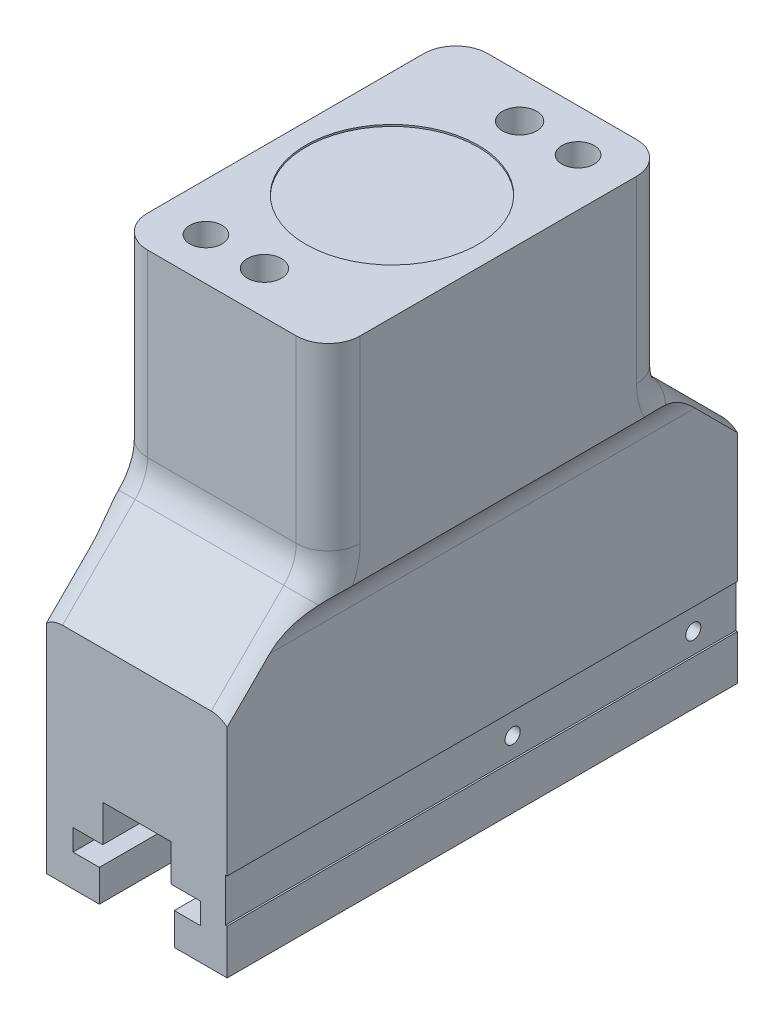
ISO-10303-21;
HEADER;
FILE_DESCRIPTION(('STEP AP214'),'2;1');
FILE_NAME('part.step','',(''),(''),'','','');
FILE_SCHEMA(('AUTOMOTIVE_DESIGN { 1 0 10303 214 1 1 1 1 }'));
ENDSEC;
DATA;
#1=APPLICATION_CONTEXT('core data for automotive mechanical design processes');
#2=APPLICATION_PROTOCOL_DEFINITION('international standard','automotive_design',2000,#1);
#3=PRODUCT_CONTEXT('',#1,'mechanical');
#4=PRODUCT('Part','Part','',(#3));
#5=PRODUCT_RELATED_PRODUCT_CATEGORY('part','',(#4));
#6=PRODUCT_DEFINITION_FORMATION('','',#4);
#7=PRODUCT_DEFINITION_CONTEXT('part definition',#1,'design');
#8=PRODUCT_DEFINITION('design','',#6,#7);
#9=PRODUCT_DEFINITION_SHAPE('','',#8);
#10=(LENGTH_UNIT() NAMED_UNIT(*) SI_UNIT(.MILLI.,.METRE.));
#11=(NAMED_UNIT(*) PLANE_ANGLE_UNIT() SI_UNIT($,.RADIAN.));
#12=(NAMED_UNIT(*) SI_UNIT($,.STERADIAN.) SOLID_ANGLE_UNIT());
#13=UNCERTAINTY_MEASURE_WITH_UNIT(LENGTH_MEASURE(1.E-05),#10,'distance_accuracy_value','');
#14=(GEOMETRIC_REPRESENTATION_CONTEXT(3) GLOBAL_UNCERTAINTY_ASSIGNED_CONTEXT((#13)) GLOBAL_UNIT_ASSIGNED_CONTEXT((#10,
#11,#12)) REPRESENTATION_CONTEXT('',''));
#15=CARTESIAN_POINT('',(0.,0.,0.));
#16=DIRECTION('',(0.,0.,1.));
#17=DIRECTION('',(1.,0.,0.));
#18=AXIS2_PLACEMENT_3D('',#15,#16,#17);
#19=CARTESIAN_POINT('',(13.4874,5.9944,38.1));
#20=DIRECTION('',(-1.,0.,0.));
#21=DIRECTION('',(0.,0.,1.));
#22=AXIS2_PLACEMENT_3D('',#19,#20,#21);
#23=PLANE('',#22);
#24=DIRECTION('',(0.,-1.,0.));
#25=VECTOR('',#24,1.);
#26=CARTESIAN_POINT('',(13.4874,5.9944,-38.1));
#27=LINE('',#26,#25);
#28=CARTESIAN_POINT('',(13.4874,-31.0388,-38.1));
#29=VERTEX_POINT('',#28);
#30=CARTESIAN_POINT('',(13.4874,-37.7444,-38.1));
#31=VERTEX_POINT('',#30);
#32=EDGE_CURVE('E459',#29,#31,#27,.T.);
#33=ORIENTED_EDGE('',*,*,#32,.F.);
#34=DIRECTION('',(0.,0.,1.));
#35=VECTOR('',#34,1.);
#36=CARTESIAN_POINT('',(13.4874,-31.0388,-38.1));
#37=LINE('',#36,#35);
#38=CARTESIAN_POINT('',(13.4874,-31.0388,38.1));
#39=VERTEX_POINT('',#38);
#40=EDGE_CURVE('E710',#29,#39,#37,.T.);
#41=ORIENTED_EDGE('',*,*,#40,.T.);
#42=DIRECTION('',(0.,-1.,0.));
#43=VECTOR('',#42,1.);
#44=CARTESIAN_POINT('',(13.4874,5.9944,38.1));
#45=LINE('',#44,#43);
#46=CARTESIAN_POINT('',(13.4874,-37.7444,38.1));
#47=VERTEX_POINT('',#46);
#48=EDGE_CURVE('E447',#39,#47,#45,.T.);
#49=ORIENTED_EDGE('',*,*,#48,.T.);
#50=DIRECTION('',(0.,0.,-1.));
#51=VECTOR('',#50,1.);
#52=CARTESIAN_POINT('',(13.4874,-37.7444,38.1));
#53=LINE('',#52,#51);
#54=EDGE_CURVE('E456',#47,#31,#53,.T.);
#55=ORIENTED_EDGE('',*,*,#54,.T.);
#56=EDGE_LOOP('',(#33,#41,#49,#55));
#57=FACE_BOUND('',#56,.T.);
#58=ADVANCED_FACE('F39',(#57),#23,.F.);
#59=CARTESIAN_POINT('',(-5.08,-37.7444,-38.1));
#60=DIRECTION('',(-1.,0.,0.));
#61=DIRECTION('',(0.,0.,1.));
#62=AXIS2_PLACEMENT_3D('',#59,#60,#61);
#63=PLANE('',#62);
#64=DIRECTION('',(0.,-1.,0.));
#65=VECTOR('',#64,1.);
#66=CARTESIAN_POINT('',(-5.08,-37.7444,38.1));
#67=LINE('',#66,#65);
#68=CARTESIAN_POINT('',(-5.08,-24.3078,38.1));
#69=VERTEX_POINT('',#68);
#70=CARTESIAN_POINT('',(-5.08,-29.7942,38.1));
#71=VERTEX_POINT('',#70);
#72=EDGE_CURVE('E752',#69,#71,#67,.T.);
#73=ORIENTED_EDGE('',*,*,#72,.T.);
#74=DIRECTION('',(0.,0.,-1.));
#75=VECTOR('',#74,1.);
#76=CARTESIAN_POINT('',(-5.08,-29.7942,-38.1));
#77=LINE('',#76,#75);
#78=CARTESIAN_POINT('',(-5.08,-29.7942,-38.1));
#79=VERTEX_POINT('',#78);
#80=EDGE_CURVE('E743',#71,#79,#77,.T.);
#81=ORIENTED_EDGE('',*,*,#80,.T.);
#82=DIRECTION('',(0.,-1.,0.));
#83=VECTOR('',#82,1.);
#84=CARTESIAN_POINT('',(-5.08,-37.7444,-38.1));
#85=LINE('',#84,#83);
#86=CARTESIAN_POINT('',(-5.08,-24.3078,-38.1));
#87=VERTEX_POINT('',#86);
#88=EDGE_CURVE('E753',#87,#79,#85,.T.);
#89=ORIENTED_EDGE('',*,*,#88,.F.);
#90=DIRECTION('',(0.,0.,1.));
#91=VECTOR('',#90,1.);
#92=CARTESIAN_POINT('',(-5.08,-24.3078,-38.1));
#93=LINE('',#92,#91);
#94=EDGE_CURVE('E769',#87,#69,#93,.T.);
#95=ORIENTED_EDGE('',*,*,#94,.T.);
#96=EDGE_LOOP('',(#73,#81,#89,#95));
#97=FACE_BOUND('',#96,.T.);
#98=ADVANCED_FACE('F410',(#97),#63,.F.);
#99=CARTESIAN_POINT('',(5.08,-37.7444,-38.1));
#100=DIRECTION('',(1.,0.,0.));
#101=DIRECTION('',(0.,1.,0.));
#102=AXIS2_PLACEMENT_3D('',#99,#100,#101);
#103=PLANE('',#102);
#104=CARTESIAN_POINT('',(5.08,-27.9818451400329,-31.75));
#105=DIRECTION('',(1.,0.,0.));
#106=DIRECTION('',(0.,1.,0.));
#107=AXIS2_PLACEMENT_3D('',#104,#105,#106);
#108=CIRCLE('',#107,1.1303);
#109=CARTESIAN_POINT('',(5.08,-26.8515451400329,-31.75));
#110=VERTEX_POINT('',#109);
#111=EDGE_CURVE('E857',#110,#110,#108,.T.);
#112=ORIENTED_EDGE('',*,*,#111,.T.);
#113=EDGE_LOOP('',(#112));
#114=FACE_BOUND('',#113,.T.);
#115=CARTESIAN_POINT('',(5.08,-27.9818451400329,-4.77520000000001));
#116=DIRECTION('',(1.,0.,0.));
#117=DIRECTION('',(0.,1.,0.));
#118=AXIS2_PLACEMENT_3D('',#115,#116,#117);
#119=CIRCLE('',#118,1.1303);
#120=CARTESIAN_POINT('',(5.08,-26.8515451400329,-4.77520000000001));
#121=VERTEX_POINT('',#120);
#122=EDGE_CURVE('E705',#121,#121,#119,.T.);
#123=ORIENTED_EDGE('',*,*,#122,.T.);
#124=EDGE_LOOP('',(#123));
#125=FACE_BOUND('',#124,.T.);
#126=DIRECTION('',(0.,1.,0.));
#127=VECTOR('',#126,1.);
#128=CARTESIAN_POINT('',(5.08,-37.7444,-38.1));
#129=LINE('',#128,#127);
#130=CARTESIAN_POINT('',(5.08,-29.7942,-38.1));
#131=VERTEX_POINT('',#130);
#132=CARTESIAN_POINT('',(5.08,-24.3078,-38.1));
#133=VERTEX_POINT('',#132);
#134=EDGE_CURVE('E756',#131,#133,#129,.T.);
#135=ORIENTED_EDGE('',*,*,#134,.F.);
#136=DIRECTION('',(0.,0.,1.));
#137=VECTOR('',#136,1.);
#138=CARTESIAN_POINT('',(5.08,-29.7942,-38.1));
#139=LINE('',#138,#137);
#140=CARTESIAN_POINT('',(5.08,-29.7942,38.1));
#141=VERTEX_POINT('',#140);
#142=EDGE_CURVE('E11',#131,#141,#139,.T.);
#143=ORIENTED_EDGE('',*,*,#142,.T.);
#144=DIRECTION('',(0.,1.,0.));
#145=VECTOR('',#144,1.);
#146=CARTESIAN_POINT('',(5.08,-37.7444,38.1));
#147=LINE('',#146,#145);
#148=CARTESIAN_POINT('',(5.08,-24.3078,38.1));
#149=VERTEX_POINT('',#148);
#150=EDGE_CURVE('E765',#141,#149,#147,.T.);
#151=ORIENTED_EDGE('',*,*,#150,.T.);
#152=DIRECTION('',(0.,0.,1.));
#153=VECTOR('',#152,1.);
#154=CARTESIAN_POINT('',(5.08,-24.3078,-38.1));
#155=LINE('',#154,#153);
#156=EDGE_CURVE('E762',#133,#149,#155,.T.);
#157=ORIENTED_EDGE('',*,*,#156,.F.);
#158=EDGE_LOOP('',(#135,#143,#151,#157));
#159=FACE_BOUND('',#158,.T.);
#160=ADVANCED_FACE('F417',(#114,#125,#159),#103,.F.);
#161=CARTESIAN_POINT('',(-15.875,-37.7444,38.1));
#162=DIRECTION('',(0.,1.,0.));
#163=DIRECTION('',(0.,0.,1.));
#164=AXIS2_PLACEMENT_3D('',#161,#162,#163);
#165=PLANE('',#164);
#166=DIRECTION('',(-1.,0.,0.));
#167=VECTOR('',#166,1.);
#168=CARTESIAN_POINT('',(-15.875,-37.7444,-38.1));
#169=LINE('',#168,#167);
#170=CARTESIAN_POINT('',(-5.588,-37.7444,-38.1));
#171=VERTEX_POINT('',#170);
#172=CARTESIAN_POINT('',(-13.4874,-37.7444,-38.1));
#173=VERTEX_POINT('',#172);
#174=EDGE_CURVE('E309',#171,#173,#169,.T.);
#175=ORIENTED_EDGE('',*,*,#174,.F.);
#176=DIRECTION('',(0.,0.,1.));
#177=VECTOR('',#176,1.);
#178=CARTESIAN_POINT('',(-5.588,-37.7444,-38.1));
#179=LINE('',#178,#177);
#180=CARTESIAN_POINT('',(-5.588,-37.7444,38.1));
#181=VERTEX_POINT('',#180);
#182=EDGE_CURVE('E294',#171,#181,#179,.T.);
#183=ORIENTED_EDGE('',*,*,#182,.T.);
#184=DIRECTION('',(1.,0.,0.));
#185=VECTOR('',#184,1.);
#186=CARTESIAN_POINT('',(-15.875,-37.7444,38.1));
#187=LINE('',#186,#185);
#188=CARTESIAN_POINT('',(-13.4874,-37.7444,38.1));
#189=VERTEX_POINT('',#188);
#190=EDGE_CURVE('E320',#189,#181,#187,.T.);
#191=ORIENTED_EDGE('',*,*,#190,.F.);
#192=DIRECTION('',(0.,0.,1.));
#193=VECTOR('',#192,1.);
#194=CARTESIAN_POINT('',(-13.4874,-37.7444,38.1));
#195=LINE('',#194,#193);
#196=EDGE_CURVE('E318',#173,#189,#195,.T.);
#197=ORIENTED_EDGE('',*,*,#196,.F.);
#198=EDGE_LOOP('',(#175,#183,#191,#197));
#199=FACE_BOUND('',#198,.T.);
#200=ADVANCED_FACE('F316',(#199),#165,.F.);
#201=CARTESIAN_POINT('',(-15.875,37.7444,-38.1));
#202=DIRECTION('',(1.,0.,0.));
#203=DIRECTION('',(0.,0.,-1.));
#204=AXIS2_PLACEMENT_3D('',#201,#202,#203);
#205=PLANE('',#204);
#206=CARTESIAN_POINT('',(-15.875,32.5882,12.192));
#207=DIRECTION('',(-1.,0.,0.));
#208=DIRECTION('',(0.,0.,1.));
#209=AXIS2_PLACEMENT_3D('',#206,#207,#208);
#210=CIRCLE('',#209,2.0193);
#211=CARTESIAN_POINT('',(-15.875,32.5882,14.2113));
#212=VERTEX_POINT('',#211);
#213=EDGE_CURVE('E776',#212,#212,#210,.T.);
#214=ORIENTED_EDGE('',*,*,#213,.F.);
#215=EDGE_LOOP('',(#214));
#216=FACE_BOUND('',#215,.T.);
#217=CARTESIAN_POINT('',(-15.875,11.7602,12.192));
#218=DIRECTION('',(-1.,0.,0.));
#219=DIRECTION('',(0.,0.,1.));
#220=AXIS2_PLACEMENT_3D('',#217,#218,#219);
#221=CIRCLE('',#220,2.0193);
#222=CARTESIAN_POINT('',(-15.875,11.7602,14.2113));
#223=VERTEX_POINT('',#222);
#224=EDGE_CURVE('E782',#223,#223,#221,.T.);
#225=ORIENTED_EDGE('',*,*,#224,.F.);
#226=EDGE_LOOP('',(#225));
#227=FACE_BOUND('',#226,.T.);
#228=DIRECTION('',(0.,-1.,0.));
#229=VECTOR('',#228,1.);
#230=CARTESIAN_POINT('',(-15.875,37.7444,-20.6248));
#231=LINE('',#230,#229);
#232=CARTESIAN_POINT('',(-15.875,37.7444,-20.6248));
#233=VERTEX_POINT('',#232);
#234=CARTESIAN_POINT('',(-15.875,10.9106561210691,-20.6248));
#235=VERTEX_POINT('',#234);
#236=EDGE_CURVE('E640',#233,#235,#231,.T.);
#237=ORIENTED_EDGE('',*,*,#236,.T.);
#238=CARTESIAN_POINT('',(-15.875,10.9106561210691,-31.75));
#239=DIRECTION('',(1.,0.,0.));
#240=DIRECTION('',(0.,0.,-1.));
#241=AXIS2_PLACEMENT_3D('',#238,#239,#240);
#242=CIRCLE('',#241,11.1252);
#243=CARTESIAN_POINT('',(-15.875,5.9944,-21.7699949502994));
#244=VERTEX_POINT('',#243);
#245=EDGE_CURVE('E642',#235,#244,#242,.T.);
#246=ORIENTED_EDGE('',*,*,#245,.T.);
#247=DIRECTION('',(0.,0.,-1.));
#248=VECTOR('',#247,1.);
#249=CARTESIAN_POINT('',(-15.875,5.9944,38.1));
#250=LINE('',#249,#248);
#251=CARTESIAN_POINT('',(-15.875,5.99440000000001,21.7699949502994));
#252=VERTEX_POINT('',#251);
#253=EDGE_CURVE('E657',#252,#244,#250,.T.);
#254=ORIENTED_EDGE('',*,*,#253,.F.);
#255=CARTESIAN_POINT('',(-15.875,10.9106561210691,31.75));
#256=DIRECTION('',(1.,0.,0.));
#257=DIRECTION('',(0.,0.,-1.));
#258=AXIS2_PLACEMENT_3D('',#255,#256,#257);
#259=CIRCLE('',#258,11.1252);
#260=CARTESIAN_POINT('',(-15.875,10.9106561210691,20.6248));
#261=VERTEX_POINT('',#260);
#262=EDGE_CURVE('E638',#252,#261,#259,.T.);
#263=ORIENTED_EDGE('',*,*,#262,.T.);
#264=DIRECTION('',(0.,1.,0.));
#265=VECTOR('',#264,1.);
#266=CARTESIAN_POINT('',(-15.875,37.7444,20.6248));
#267=LINE('',#266,#265);
#268=CARTESIAN_POINT('',(-15.875,37.7444,20.6248));
#269=VERTEX_POINT('',#268);
#270=EDGE_CURVE('E636',#261,#269,#267,.T.);
#271=ORIENTED_EDGE('',*,*,#270,.T.);
#272=DIRECTION('',(0.,0.,1.));
#273=VECTOR('',#272,1.);
#274=CARTESIAN_POINT('',(-15.875,37.7444,-38.1));
#275=LINE('',#274,#273);
#276=EDGE_CURVE('E323',#233,#269,#275,.T.);
#277=ORIENTED_EDGE('',*,*,#276,.F.);
#278=EDGE_LOOP('',(#237,#246,#254,#263,#271,#277));
#279=FACE_BOUND('',#278,.T.);
#280=ADVANCED_FACE('F661',(#216,#227,#279),#205,.F.);
#281=CARTESIAN_POINT('',(15.875,37.7444,-38.1));
#282=DIRECTION('',(-1.,0.,0.));
#283=DIRECTION('',(0.,0.,1.));
#284=AXIS2_PLACEMENT_3D('',#281,#282,#283);
#285=PLANE('',#284);
#286=DIRECTION('',(0.,0.,1.));
#287=VECTOR('',#286,1.);
#288=CARTESIAN_POINT('',(15.875,5.9944,38.1));
#289=LINE('',#288,#287);
#290=CARTESIAN_POINT('',(15.875,5.99440000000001,-21.7699949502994));
#291=VERTEX_POINT('',#290);
#292=CARTESIAN_POINT('',(15.875,5.9944,21.7699949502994));
#293=VERTEX_POINT('',#292);
#294=EDGE_CURVE('E671',#291,#293,#289,.T.);
#295=ORIENTED_EDGE('',*,*,#294,.F.);
#296=CARTESIAN_POINT('',(15.875,10.9106561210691,-31.75));
#297=DIRECTION('',(-1.,0.,0.));
#298=DIRECTION('',(0.,0.,1.));
#299=AXIS2_PLACEMENT_3D('',#296,#297,#298);
#300=CIRCLE('',#299,11.1252);
#301=CARTESIAN_POINT('',(15.875,10.9106561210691,-20.6248));
#302=VERTEX_POINT('',#301);
#303=EDGE_CURVE('E596',#291,#302,#300,.T.);
#304=ORIENTED_EDGE('',*,*,#303,.T.);
#305=DIRECTION('',(0.,-1.,0.));
#306=VECTOR('',#305,1.);
#307=CARTESIAN_POINT('',(15.875,37.7444,-20.6248));
#308=LINE('',#307,#306);
#309=CARTESIAN_POINT('',(15.875,37.7444,-20.6248));
#310=VERTEX_POINT('',#309);
#311=EDGE_CURVE('E483',#302,#310,#308,.F.);
#312=ORIENTED_EDGE('',*,*,#311,.T.);
#313=DIRECTION('',(0.,0.,-1.));
#314=VECTOR('',#313,1.);
#315=CARTESIAN_POINT('',(15.875,37.7444,-38.1));
#316=LINE('',#315,#314);
#317=CARTESIAN_POINT('',(15.875,37.7444,20.6248));
#318=VERTEX_POINT('',#317);
#319=EDGE_CURVE('E332',#318,#310,#316,.T.);
#320=ORIENTED_EDGE('',*,*,#319,.F.);
#321=DIRECTION('',(0.,1.,0.));
#322=VECTOR('',#321,1.);
#323=CARTESIAN_POINT('',(15.875,37.7444,20.6248));
#324=LINE('',#323,#322);
#325=CARTESIAN_POINT('',(15.875,10.9106561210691,20.6248));
#326=VERTEX_POINT('',#325);
#327=EDGE_CURVE('E514',#318,#326,#324,.F.);
#328=ORIENTED_EDGE('',*,*,#327,.T.);
#329=CARTESIAN_POINT('',(15.875,10.9106561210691,31.75));
#330=DIRECTION('',(-1.,0.,0.));
#331=DIRECTION('',(0.,0.,1.));
#332=AXIS2_PLACEMENT_3D('',#329,#330,#331);
#333=CIRCLE('',#332,11.1252);
#334=EDGE_CURVE('E511',#326,#293,#333,.T.);
#335=ORIENTED_EDGE('',*,*,#334,.T.);
#336=EDGE_LOOP('',(#295,#304,#312,#320,#328,#335));
#337=FACE_BOUND('',#336,.T.);
#338=ADVANCED_FACE('F825',(#337),#285,.F.);
#339=CARTESIAN_POINT('',(-15.875,37.7444,38.1));
#340=DIRECTION('',(0.,0.,-1.));
#341=DIRECTION('',(-1.,0.,0.));
#342=AXIS2_PLACEMENT_3D('',#339,#340,#341);
#343=PLANE('',#342);
#344=ORIENTED_EDGE('',*,*,#190,.T.);
#345=DIRECTION('',(0.,-1.,0.));
#346=VECTOR('',#345,1.);
#347=CARTESIAN_POINT('',(-5.588,-37.7444,38.1));
#348=LINE('',#347,#346);
#349=CARTESIAN_POINT('',(-5.588,-32.9692,38.1));
#350=VERTEX_POINT('',#349);
#351=EDGE_CURVE('E297',#350,#181,#348,.T.);
#352=ORIENTED_EDGE('',*,*,#351,.F.);
#353=DIRECTION('',(1.,0.,0.));
#354=VECTOR('',#353,1.);
#355=CARTESIAN_POINT('',(-9.525,-32.9692,38.1));
#356=LINE('',#355,#354);
#357=CARTESIAN_POINT('',(-9.525,-32.9692,38.1));
#358=VERTEX_POINT('',#357);
#359=EDGE_CURVE('E732',#358,#350,#356,.T.);
#360=ORIENTED_EDGE('',*,*,#359,.F.);
#361=DIRECTION('',(0.,-1.,0.));
#362=VECTOR('',#361,1.);
#363=CARTESIAN_POINT('',(-9.525,-29.7942,38.1));
#364=LINE('',#363,#362);
#365=CARTESIAN_POINT('',(-9.525,-29.7942,38.1));
#366=VERTEX_POINT('',#365);
#367=EDGE_CURVE('E712',#366,#358,#364,.T.);
#368=ORIENTED_EDGE('',*,*,#367,.F.);
#369=DIRECTION('',(-1.,0.,0.));
#370=VECTOR('',#369,1.);
#371=CARTESIAN_POINT('',(-9.525,-29.7942,38.1));
#372=LINE('',#371,#370);
#373=EDGE_CURVE('E738',#71,#366,#372,.T.);
#374=ORIENTED_EDGE('',*,*,#373,.F.);
#375=ORIENTED_EDGE('',*,*,#72,.F.);
#376=DIRECTION('',(-1.,0.,0.));
#377=VECTOR('',#376,1.);
#378=CARTESIAN_POINT('',(-5.08,-24.3078,38.1));
#379=LINE('',#378,#377);
#380=EDGE_CURVE('E757',#149,#69,#379,.T.);
#381=ORIENTED_EDGE('',*,*,#380,.F.);
#382=ORIENTED_EDGE('',*,*,#150,.F.);
#383=CARTESIAN_POINT('',(9.525,-29.7942,38.1));
#384=VERTEX_POINT('',#383);
#385=EDGE_CURVE('E719',#384,#141,#372,.T.);
#386=ORIENTED_EDGE('',*,*,#385,.F.);
#387=DIRECTION('',(0.,1.,0.));
#388=VECTOR('',#387,1.);
#389=CARTESIAN_POINT('',(9.525,-29.7942,38.1));
#390=LINE('',#389,#388);
#391=CARTESIAN_POINT('',(9.525,-32.9692,38.1));
#392=VERTEX_POINT('',#391);
#393=EDGE_CURVE('E735',#392,#384,#390,.T.);
#394=ORIENTED_EDGE('',*,*,#393,.F.);
#395=CARTESIAN_POINT('',(5.588,-32.9692,38.1));
#396=VERTEX_POINT('',#395);
#397=EDGE_CURVE('E731',#396,#392,#356,.T.);
#398=ORIENTED_EDGE('',*,*,#397,.F.);
#399=DIRECTION('',(0.,1.,0.));
#400=VECTOR('',#399,1.);
#401=CARTESIAN_POINT('',(5.588,-37.7444,38.1));
#402=LINE('',#401,#400);
#403=CARTESIAN_POINT('',(5.588,-37.7444,38.1));
#404=VERTEX_POINT('',#403);
#405=EDGE_CURVE('E54',#404,#396,#402,.T.);
#406=ORIENTED_EDGE('',*,*,#405,.F.);
#407=EDGE_CURVE('E324',#404,#47,#187,.T.);
#408=ORIENTED_EDGE('',*,*,#407,.T.);
#409=ORIENTED_EDGE('',*,*,#48,.F.);
#410=DIRECTION('',(1.,0.,0.));
#411=VECTOR('',#410,1.);
#412=CARTESIAN_POINT('',(13.4874,-31.0388,38.1));
#413=LINE('',#412,#411);
#414=CARTESIAN_POINT('',(13.2334,-31.0388,38.1));
#415=VERTEX_POINT('',#414);
#416=EDGE_CURVE('E708',#415,#39,#413,.T.);
#417=ORIENTED_EDGE('',*,*,#416,.F.);
#418=DIRECTION('',(0.,-1.,0.));
#419=VECTOR('',#418,1.);
#420=CARTESIAN_POINT('',(13.2334,-31.0388,38.1));
#421=LINE('',#420,#419);
#422=CARTESIAN_POINT('',(13.2334,-24.5618,38.1));
#423=VERTEX_POINT('',#422);
#424=EDGE_CURVE('E704',#423,#415,#421,.T.);
#425=ORIENTED_EDGE('',*,*,#424,.F.);
#426=DIRECTION('',(-1.,0.,0.));
#427=VECTOR('',#426,1.);
#428=CARTESIAN_POINT('',(13.4874,-24.5618,38.1));
#429=LINE('',#428,#427);
#430=CARTESIAN_POINT('',(13.4874,-24.5618,38.1));
#431=VERTEX_POINT('',#430);
#432=EDGE_CURVE('E701',#431,#423,#429,.T.);
#433=ORIENTED_EDGE('',*,*,#432,.F.);
#434=CARTESIAN_POINT('',(13.4874,-5.32435089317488,38.1));
#435=VERTEX_POINT('',#434);
#436=EDGE_CURVE('E437',#435,#431,#45,.T.);
#437=ORIENTED_EDGE('',*,*,#436,.F.);
#438=CARTESIAN_POINT('',(11.0998,-11.172752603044,38.1));
#439=DIRECTION('',(0.,0.,-1.));
#440=DIRECTION('',(0.,1.,0.));
#441=AXIS2_PLACEMENT_3D('',#438,#439,#440);
#442=ELLIPSE('',#441,6.75315260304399,4.7752);
#443=CARTESIAN_POINT('',(11.0998,-4.41959999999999,38.1));
#444=VERTEX_POINT('',#443);
#445=EDGE_CURVE('E591',#435,#444,#442,.F.);
#446=ORIENTED_EDGE('',*,*,#445,.T.);
#447=DIRECTION('',(1.,0.,0.));
#448=VECTOR('',#447,1.);
#449=CARTESIAN_POINT('',(-15.875,-4.4196,38.1));
#450=LINE('',#449,#448);
#451=CARTESIAN_POINT('',(-11.0998,-4.4196,38.1));
#452=VERTEX_POINT('',#451);
#453=EDGE_CURVE('E461',#452,#444,#450,.T.);
#454=ORIENTED_EDGE('',*,*,#453,.F.);
#455=CARTESIAN_POINT('',(-11.0998,-11.172752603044,38.1));
#456=DIRECTION('',(0.,0.,-1.));
#457=DIRECTION('',(0.,1.,0.));
#458=AXIS2_PLACEMENT_3D('',#455,#456,#457);
#459=ELLIPSE('',#458,6.75315260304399,4.7752);
#460=CARTESIAN_POINT('',(-13.4874,-5.3243508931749,38.1));
#461=VERTEX_POINT('',#460);
#462=EDGE_CURVE('E627',#452,#461,#459,.F.);
#463=ORIENTED_EDGE('',*,*,#462,.T.);
#464=DIRECTION('',(0.,-1.,0.));
#465=VECTOR('',#464,1.);
#466=CARTESIAN_POINT('',(-13.4874,5.9944,38.1));
#467=LINE('',#466,#465);
#468=EDGE_CURVE('E664',#461,#189,#467,.T.);
#469=ORIENTED_EDGE('',*,*,#468,.T.);
#470=EDGE_LOOP('',(#344,#352,#360,#368,#374,#375,#381,#382,#386,#394,#398,#406,#408,#409,#417,
#425,#433,#437,#446,#454,#463,#469));
#471=FACE_BOUND('',#470,.T.);
#472=ADVANCED_FACE('F817',(#471),#343,.F.);
#473=CARTESIAN_POINT('',(-15.875,37.7444,-38.1));
#474=DIRECTION('',(0.,0.,1.));
#475=DIRECTION('',(1.,0.,0.));
#476=AXIS2_PLACEMENT_3D('',#473,#474,#475);
#477=PLANE('',#476);
#478=DIRECTION('',(1.,0.,0.));
#479=VECTOR('',#478,1.);
#480=CARTESIAN_POINT('',(-9.525,-32.9692,-38.1));
#481=LINE('',#480,#479);
#482=CARTESIAN_POINT('',(-9.525,-32.9692,-38.1));
#483=VERTEX_POINT('',#482);
#484=CARTESIAN_POINT('',(-5.588,-32.9692,-38.1));
#485=VERTEX_POINT('',#484);
#486=EDGE_CURVE('E313',#483,#485,#481,.T.);
#487=ORIENTED_EDGE('',*,*,#486,.T.);
#488=DIRECTION('',(0.,-1.,0.));
#489=VECTOR('',#488,1.);
#490=CARTESIAN_POINT('',(-5.588,-37.7444,-38.1));
#491=LINE('',#490,#489);
#492=EDGE_CURVE('E62',#485,#171,#491,.T.);
#493=ORIENTED_EDGE('',*,*,#492,.T.);
#494=ORIENTED_EDGE('',*,*,#174,.T.);
#495=DIRECTION('',(0.,-1.,0.));
#496=VECTOR('',#495,1.);
#497=CARTESIAN_POINT('',(-13.4874,5.9944,-38.1));
#498=LINE('',#497,#496);
#499=CARTESIAN_POINT('',(-13.4874,-5.3243508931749,-38.1));
#500=VERTEX_POINT('',#499);
#501=EDGE_CURVE('E622',#500,#173,#498,.T.);
#502=ORIENTED_EDGE('',*,*,#501,.F.);
#503=CARTESIAN_POINT('',(-11.0998,-11.172752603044,-38.1));
#504=DIRECTION('',(0.,0.,1.));
#505=DIRECTION('',(0.,-1.,0.));
#506=AXIS2_PLACEMENT_3D('',#503,#504,#505);
#507=ELLIPSE('',#506,6.75315260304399,4.7752);
#508=CARTESIAN_POINT('',(-11.0998,-4.4196,-38.1));
#509=VERTEX_POINT('',#508);
#510=EDGE_CURVE('E621',#500,#509,#507,.F.);
#511=ORIENTED_EDGE('',*,*,#510,.T.);
#512=DIRECTION('',(1.,0.,0.));
#513=VECTOR('',#512,1.);
#514=CARTESIAN_POINT('',(-15.875,-4.4196,-38.1));
#515=LINE('',#514,#513);
#516=CARTESIAN_POINT('',(11.0998,-4.41959999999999,-38.1));
#517=VERTEX_POINT('',#516);
#518=EDGE_CURVE('E450',#509,#517,#515,.T.);
#519=ORIENTED_EDGE('',*,*,#518,.T.);
#520=CARTESIAN_POINT('',(11.0998,-11.172752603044,-38.1));
#521=DIRECTION('',(0.,0.,1.));
#522=DIRECTION('',(0.,-1.,0.));
#523=AXIS2_PLACEMENT_3D('',#520,#521,#522);
#524=ELLIPSE('',#523,6.75315260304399,4.7752);
#525=CARTESIAN_POINT('',(13.4874,-5.32435089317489,-38.1));
#526=VERTEX_POINT('',#525);
#527=EDGE_CURVE('E549',#517,#526,#524,.F.);
#528=ORIENTED_EDGE('',*,*,#527,.T.);
#529=CARTESIAN_POINT('',(13.4874,-24.5618,-38.1));
#530=VERTEX_POINT('',#529);
#531=EDGE_CURVE('E453',#526,#530,#27,.T.);
#532=ORIENTED_EDGE('',*,*,#531,.T.);
#533=DIRECTION('',(-1.,0.,0.));
#534=VECTOR('',#533,1.);
#535=CARTESIAN_POINT('',(13.4874,-24.5618,-38.1));
#536=LINE('',#535,#534);
#537=CARTESIAN_POINT('',(13.2334,-24.5618,-38.1));
#538=VERTEX_POINT('',#537);
#539=EDGE_CURVE('E697',#530,#538,#536,.T.);
#540=ORIENTED_EDGE('',*,*,#539,.T.);
#541=DIRECTION('',(0.,-1.,0.));
#542=VECTOR('',#541,1.);
#543=CARTESIAN_POINT('',(13.2334,-31.0388,-38.1));
#544=LINE('',#543,#542);
#545=CARTESIAN_POINT('',(13.2334,-31.0388,-38.1));
#546=VERTEX_POINT('',#545);
#547=EDGE_CURVE('E692',#538,#546,#544,.T.);
#548=ORIENTED_EDGE('',*,*,#547,.T.);
#549=DIRECTION('',(1.,0.,0.));
#550=VECTOR('',#549,1.);
#551=CARTESIAN_POINT('',(13.4874,-31.0388,-38.1));
#552=LINE('',#551,#550);
#553=EDGE_CURVE('E689',#546,#29,#552,.T.);
#554=ORIENTED_EDGE('',*,*,#553,.T.);
#555=ORIENTED_EDGE('',*,*,#32,.T.);
#556=CARTESIAN_POINT('',(5.588,-37.7444,-38.1));
#557=VERTEX_POINT('',#556);
#558=EDGE_CURVE('E319',#31,#557,#169,.T.);
#559=ORIENTED_EDGE('',*,*,#558,.T.);
#560=DIRECTION('',(0.,1.,0.));
#561=VECTOR('',#560,1.);
#562=CARTESIAN_POINT('',(5.588,-37.7444,-38.1));
#563=LINE('',#562,#561);
#564=CARTESIAN_POINT('',(5.588,-32.9692,-38.1));
#565=VERTEX_POINT('',#564);
#566=EDGE_CURVE('E303',#557,#565,#563,.T.);
#567=ORIENTED_EDGE('',*,*,#566,.T.);
#568=CARTESIAN_POINT('',(9.525,-32.9692,-38.1));
#569=VERTEX_POINT('',#568);
#570=EDGE_CURVE('E718',#565,#569,#481,.T.);
#571=ORIENTED_EDGE('',*,*,#570,.T.);
#572=DIRECTION('',(0.,1.,0.));
#573=VECTOR('',#572,1.);
#574=CARTESIAN_POINT('',(9.525,-29.7942,-38.1));
#575=LINE('',#574,#573);
#576=CARTESIAN_POINT('',(9.525,-29.7942,-38.1));
#577=VERTEX_POINT('',#576);
#578=EDGE_CURVE('E721',#569,#577,#575,.T.);
#579=ORIENTED_EDGE('',*,*,#578,.T.);
#580=DIRECTION('',(-1.,0.,0.));
#581=VECTOR('',#580,1.);
#582=CARTESIAN_POINT('',(-9.525,-29.7942,-38.1));
#583=LINE('',#582,#581);
#584=EDGE_CURVE('E725',#577,#131,#583,.T.);
#585=ORIENTED_EDGE('',*,*,#584,.T.);
#586=ORIENTED_EDGE('',*,*,#134,.T.);
#587=DIRECTION('',(-1.,0.,0.));
#588=VECTOR('',#587,1.);
#589=CARTESIAN_POINT('',(-5.08,-24.3078,-38.1));
#590=LINE('',#589,#588);
#591=EDGE_CURVE('E759',#133,#87,#590,.T.);
#592=ORIENTED_EDGE('',*,*,#591,.T.);
#593=ORIENTED_EDGE('',*,*,#88,.T.);
#594=CARTESIAN_POINT('',(-9.525,-29.7942,-38.1));
#595=VERTEX_POINT('',#594);
#596=EDGE_CURVE('E724',#79,#595,#583,.T.);
#597=ORIENTED_EDGE('',*,*,#596,.T.);
#598=DIRECTION('',(0.,-1.,0.));
#599=VECTOR('',#598,1.);
#600=CARTESIAN_POINT('',(-9.525,-29.7942,-38.1));
#601=LINE('',#600,#599);
#602=EDGE_CURVE('E716',#595,#483,#601,.T.);
#603=ORIENTED_EDGE('',*,*,#602,.T.);
#604=EDGE_LOOP('',(#487,#493,#494,#502,#511,#519,#528,#532,#540,#548,#554,#555,#559,#567,#571,
#579,#585,#586,#592,#593,#597,#603));
#605=FACE_BOUND('',#604,.T.);
#606=ADVANCED_FACE('F307',(#605),#477,.F.);
#607=CARTESIAN_POINT('',(-15.875,37.7444,38.1));
#608=DIRECTION('',(0.,1.,0.));
#609=DIRECTION('',(0.,0.,1.));
#610=AXIS2_PLACEMENT_3D('',#607,#608,#609);
#611=PLANE('',#610);
#612=CARTESIAN_POINT('',(0.,37.7444,0.));
#613=DIRECTION('',(0.,1.,0.));
#614=DIRECTION('',(0.,0.,1.));
#615=AXIS2_PLACEMENT_3D('',#612,#613,#614);
#616=CIRCLE('',#615,12.8524);
#617=CARTESIAN_POINT('',(0.,37.7444,12.8524));
#618=VERTEX_POINT('',#617);
#619=EDGE_CURVE('E864',#618,#618,#616,.T.);
#620=ORIENTED_EDGE('',*,*,#619,.F.);
#621=EDGE_LOOP('',(#620));
#622=FACE_BOUND('',#621,.T.);
#623=CARTESIAN_POINT('',(0.,37.7444,19.05));
#624=DIRECTION('',(0.,1.,0.));
#625=DIRECTION('',(0.,0.,1.));
#626=AXIS2_PLACEMENT_3D('',#623,#624,#625);
#627=CIRCLE('',#626,2.5527);
#628=CARTESIAN_POINT('',(0.,37.7444,21.6027));
#629=VERTEX_POINT('',#628);
#630=EDGE_CURVE('E788',#629,#629,#627,.T.);
#631=ORIENTED_EDGE('',*,*,#630,.F.);
#632=EDGE_LOOP('',(#631));
#633=FACE_BOUND('',#632,.T.);
#634=CARTESIAN_POINT('',(0.,37.7444,-19.05));
#635=DIRECTION('',(0.,1.,0.));
#636=DIRECTION('',(0.,0.,1.));
#637=AXIS2_PLACEMENT_3D('',#634,#635,#636);
#638=CIRCLE('',#637,2.5527);
#639=CARTESIAN_POINT('',(0.,37.7444,-16.4973));
#640=VERTEX_POINT('',#639);
#641=EDGE_CURVE('E794',#640,#640,#638,.T.);
#642=ORIENTED_EDGE('',*,*,#641,.F.);
#643=EDGE_LOOP('',(#642));
#644=FACE_BOUND('',#643,.T.);
#645=CARTESIAN_POINT('',(-8.73125,37.7444,19.05));
#646=DIRECTION('',(0.,1.,0.));
#647=DIRECTION('',(0.,0.,1.));
#648=AXIS2_PLACEMENT_3D('',#645,#646,#647);
#649=CIRCLE('',#648,2.413);
#650=CARTESIAN_POINT('',(-8.73125,37.7444,21.463));
#651=VERTEX_POINT('',#650);
#652=EDGE_CURVE('E797',#651,#651,#649,.T.);
#653=ORIENTED_EDGE('',*,*,#652,.F.);
#654=EDGE_LOOP('',(#653));
#655=FACE_BOUND('',#654,.T.);
#656=CARTESIAN_POINT('',(8.73125,37.7444,-19.05));
#657=DIRECTION('',(0.,1.,0.));
#658=DIRECTION('',(0.,0.,1.));
#659=AXIS2_PLACEMENT_3D('',#656,#657,#658);
#660=CIRCLE('',#659,2.413);
#661=CARTESIAN_POINT('',(8.73125,37.7444,-16.637));
#662=VERTEX_POINT('',#661);
#663=EDGE_CURVE('E668',#662,#662,#660,.T.);
#664=ORIENTED_EDGE('',*,*,#663,.F.);
#665=EDGE_LOOP('',(#664));
#666=FACE_BOUND('',#665,.T.);
#667=ORIENTED_EDGE('',*,*,#319,.T.);
#668=CARTESIAN_POINT('',(11.0998,37.7444,-20.6248));
#669=DIRECTION('',(0.,1.,0.));
#670=DIRECTION('',(0.,0.,1.));
#671=AXIS2_PLACEMENT_3D('',#668,#669,#670);
#672=CIRCLE('',#671,4.7752);
#673=CARTESIAN_POINT('',(11.0998,37.7444,-25.4));
#674=VERTEX_POINT('',#673);
#675=EDGE_CURVE('E475',#310,#674,#672,.T.);
#676=ORIENTED_EDGE('',*,*,#675,.T.);
#677=DIRECTION('',(1.,0.,0.));
#678=VECTOR('',#677,1.);
#679=CARTESIAN_POINT('',(-15.875,37.7444,-25.4));
#680=LINE('',#679,#678);
#681=CARTESIAN_POINT('',(-11.0998,37.7444,-25.4));
#682=VERTEX_POINT('',#681);
#683=EDGE_CURVE('E446',#682,#674,#680,.T.);
#684=ORIENTED_EDGE('',*,*,#683,.F.);
#685=CARTESIAN_POINT('',(-11.0998,37.7444,-20.6248));
#686=DIRECTION('',(0.,1.,0.));
#687=DIRECTION('',(0.,0.,1.));
#688=AXIS2_PLACEMENT_3D('',#685,#686,#687);
#689=CIRCLE('',#688,4.7752);
#690=EDGE_CURVE('E525',#682,#233,#689,.T.);
#691=ORIENTED_EDGE('',*,*,#690,.T.);
#692=ORIENTED_EDGE('',*,*,#276,.T.);
#693=CARTESIAN_POINT('',(-11.0998,37.7444,20.6248));
#694=DIRECTION('',(0.,1.,0.));
#695=DIRECTION('',(0.,0.,1.));
#696=AXIS2_PLACEMENT_3D('',#693,#694,#695);
#697=CIRCLE('',#696,4.7752);
#698=CARTESIAN_POINT('',(-11.0998,37.7444,25.4));
#699=VERTEX_POINT('',#698);
#700=EDGE_CURVE('E521',#269,#699,#697,.T.);
#701=ORIENTED_EDGE('',*,*,#700,.T.);
#702=DIRECTION('',(1.,0.,0.));
#703=VECTOR('',#702,1.);
#704=CARTESIAN_POINT('',(-15.875,37.7444,25.4));
#705=LINE('',#704,#703);
#706=CARTESIAN_POINT('',(11.0998,37.7444,25.4));
#707=VERTEX_POINT('',#706);
#708=EDGE_CURVE('E463',#699,#707,#705,.T.);
#709=ORIENTED_EDGE('',*,*,#708,.T.);
#710=CARTESIAN_POINT('',(11.0998,37.7444,20.6248));
#711=DIRECTION('',(0.,1.,0.));
#712=DIRECTION('',(0.,0.,1.));
#713=AXIS2_PLACEMENT_3D('',#710,#711,#712);
#714=CIRCLE('',#713,4.7752);
#715=EDGE_CURVE('E477',#707,#318,#714,.T.);
#716=ORIENTED_EDGE('',*,*,#715,.T.);
#717=EDGE_LOOP('',(#667,#676,#684,#691,#692,#701,#709,#716));
#718=FACE_BOUND('',#717,.T.);
#719=ADVANCED_FACE('F473',(#622,#633,#644,#655,#666,#718),#611,.T.);
#720=ORIENTED_EDGE('',*,*,#407,.F.);
#721=DIRECTION('',(0.,0.,1.));
#722=VECTOR('',#721,1.);
#723=CARTESIAN_POINT('',(5.588,-37.7444,-38.1));
#724=LINE('',#723,#722);
#725=EDGE_CURVE('E302',#557,#404,#724,.T.);
#726=ORIENTED_EDGE('',*,*,#725,.F.);
#727=ORIENTED_EDGE('',*,*,#558,.F.);
#728=ORIENTED_EDGE('',*,*,#54,.F.);
#729=EDGE_LOOP('',(#720,#726,#727,#728));
#730=FACE_BOUND('',#729,.T.);
#731=ADVANCED_FACE('F683',(#730),#165,.F.);
#732=CARTESIAN_POINT('',(-15.875,37.7444,25.4));
#733=DIRECTION('',(0.,0.,-1.));
#734=DIRECTION('',(0.,1.,0.));
#735=AXIS2_PLACEMENT_3D('',#732,#733,#734);
#736=PLANE('',#735);
#737=DIRECTION('',(1.,0.,0.));
#738=VECTOR('',#737,1.);
#739=CARTESIAN_POINT('',(15.875,10.9106561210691,25.4));
#740=LINE('',#739,#738);
#741=CARTESIAN_POINT('',(-11.0998,10.9106561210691,25.4));
#742=VERTEX_POINT('',#741);
#743=CARTESIAN_POINT('',(11.0998,10.9106561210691,25.4));
#744=VERTEX_POINT('',#743);
#745=EDGE_CURVE('E334',#742,#744,#740,.T.);
#746=ORIENTED_EDGE('',*,*,#745,.T.);
#747=DIRECTION('',(0.,1.,0.));
#748=VECTOR('',#747,1.);
#749=CARTESIAN_POINT('',(11.0998,37.7444,25.4));
#750=LINE('',#749,#748);
#751=EDGE_CURVE('E486',#744,#707,#750,.T.);
#752=ORIENTED_EDGE('',*,*,#751,.T.);
#753=ORIENTED_EDGE('',*,*,#708,.F.);
#754=DIRECTION('',(0.,1.,0.));
#755=VECTOR('',#754,1.);
#756=CARTESIAN_POINT('',(-11.0998,37.7444,25.4));
#757=LINE('',#756,#755);
#758=EDGE_CURVE('E528',#699,#742,#757,.F.);
#759=ORIENTED_EDGE('',*,*,#758,.T.);
#760=EDGE_LOOP('',(#746,#752,#753,#759));
#761=FACE_BOUND('',#760,.T.);
#762=ADVANCED_FACE('F517',(#761),#736,.F.);
#763=CARTESIAN_POINT('',(-15.875,8.28039999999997,25.4));
#764=DIRECTION('',(0.,-0.707106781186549,-0.707106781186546));
#765=DIRECTION('',(0.,0.707106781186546,-0.707106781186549));
#766=AXIS2_PLACEMENT_3D('',#763,#764,#765);
#767=PLANE('',#766);
#768=ORIENTED_EDGE('',*,*,#453,.T.);
#769=DIRECTION('',(0.,0.707106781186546,-0.707106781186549));
#770=VECTOR('',#769,1.);
#771=CARTESIAN_POINT('',(11.0998,8.28039999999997,25.4));
#772=LINE('',#771,#770);
#773=CARTESIAN_POINT('',(11.0998,6.42052806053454,27.2598719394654));
#774=VERTEX_POINT('',#773);
#775=EDGE_CURVE('E589',#444,#774,#772,.T.);
#776=ORIENTED_EDGE('',*,*,#775,.T.);
#777=DIRECTION('',(1.,0.,0.));
#778=VECTOR('',#777,1.);
#779=CARTESIAN_POINT('',(-15.875,6.42052806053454,27.2598719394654));
#780=LINE('',#779,#778);
#781=CARTESIAN_POINT('',(-11.0998,6.42052806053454,27.2598719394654));
#782=VERTEX_POINT('',#781);
#783=EDGE_CURVE('E337',#774,#782,#780,.F.);
#784=ORIENTED_EDGE('',*,*,#783,.T.);
#785=DIRECTION('',(0.,0.707106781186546,-0.707106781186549));
#786=VECTOR('',#785,1.);
#787=CARTESIAN_POINT('',(-11.0998,8.28039999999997,25.4));
#788=LINE('',#787,#786);
#789=EDGE_CURVE('E634',#782,#452,#788,.F.);
#790=ORIENTED_EDGE('',*,*,#789,.T.);
#791=EDGE_LOOP('',(#768,#776,#784,#790));
#792=FACE_BOUND('',#791,.T.);
#793=ADVANCED_FACE('F822',(#792),#767,.F.);
#794=CARTESIAN_POINT('',(-15.875,8.28039999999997,-25.4));
#795=DIRECTION('',(0.,-0.707106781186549,0.707106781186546));
#796=DIRECTION('',(0.,-0.707106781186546,-0.707106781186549));
#797=AXIS2_PLACEMENT_3D('',#794,#795,#796);
#798=PLANE('',#797);
#799=DIRECTION('',(1.,0.,0.));
#800=VECTOR('',#799,1.);
#801=CARTESIAN_POINT('',(15.875,6.42052806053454,-27.2598719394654));
#802=LINE('',#801,#800);
#803=CARTESIAN_POINT('',(-11.0998,6.42052806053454,-27.2598719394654));
#804=VERTEX_POINT('',#803);
#805=CARTESIAN_POINT('',(11.0998,6.42052806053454,-27.2598719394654));
#806=VERTEX_POINT('',#805);
#807=EDGE_CURVE('E328',#804,#806,#802,.T.);
#808=ORIENTED_EDGE('',*,*,#807,.T.);
#809=DIRECTION('',(0.,-0.707106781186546,-0.707106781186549));
#810=VECTOR('',#809,1.);
#811=CARTESIAN_POINT('',(11.0998,8.28039999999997,-25.4));
#812=LINE('',#811,#810);
#813=EDGE_CURVE('E535',#806,#517,#812,.T.);
#814=ORIENTED_EDGE('',*,*,#813,.T.);
#815=ORIENTED_EDGE('',*,*,#518,.F.);
#816=DIRECTION('',(0.,-0.707106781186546,-0.707106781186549));
#817=VECTOR('',#816,1.);
#818=CARTESIAN_POINT('',(-11.0998,8.28039999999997,-25.4));
#819=LINE('',#818,#817);
#820=EDGE_CURVE('E624',#509,#804,#819,.F.);
#821=ORIENTED_EDGE('',*,*,#820,.T.);
#822=EDGE_LOOP('',(#808,#814,#815,#821));
#823=FACE_BOUND('',#822,.T.);
#824=ADVANCED_FACE('F618',(#823),#798,.F.);
#825=CARTESIAN_POINT('',(-15.875,37.7444,-25.4));
#826=DIRECTION('',(0.,0.,1.));
#827=DIRECTION('',(0.,-1.,0.));
#828=AXIS2_PLACEMENT_3D('',#825,#826,#827);
#829=PLANE('',#828);
#830=ORIENTED_EDGE('',*,*,#683,.T.);
#831=DIRECTION('',(0.,-1.,0.));
#832=VECTOR('',#831,1.);
#833=CARTESIAN_POINT('',(11.0998,37.7444,-25.4));
#834=LINE('',#833,#832);
#835=CARTESIAN_POINT('',(11.0998,10.9106561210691,-25.4));
#836=VERTEX_POINT('',#835);
#837=EDGE_CURVE('E485',#674,#836,#834,.T.);
#838=ORIENTED_EDGE('',*,*,#837,.T.);
#839=DIRECTION('',(1.,0.,0.));
#840=VECTOR('',#839,1.);
#841=CARTESIAN_POINT('',(-15.875,10.9106561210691,-25.4));
#842=LINE('',#841,#840);
#843=CARTESIAN_POINT('',(-11.0998,10.9106561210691,-25.4));
#844=VERTEX_POINT('',#843);
#845=EDGE_CURVE('E331',#836,#844,#842,.F.);
#846=ORIENTED_EDGE('',*,*,#845,.T.);
#847=DIRECTION('',(0.,-1.,0.));
#848=VECTOR('',#847,1.);
#849=CARTESIAN_POINT('',(-11.0998,37.7444,-25.4));
#850=LINE('',#849,#848);
#851=EDGE_CURVE('E526',#844,#682,#850,.F.);
#852=ORIENTED_EDGE('',*,*,#851,.T.);
#853=EDGE_LOOP('',(#830,#838,#846,#852));
#854=FACE_BOUND('',#853,.T.);
#855=ADVANCED_FACE('F601',(#854),#829,.F.);
#856=CARTESIAN_POINT('',(-15.875,10.9106561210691,-31.75));
#857=DIRECTION('',(-1.,0.,0.));
#858=DIRECTION('',(0.,0.,1.));
#859=AXIS2_PLACEMENT_3D('',#856,#857,#858);
#860=CYLINDRICAL_SURFACE('',#859,6.35);
#861=ORIENTED_EDGE('',*,*,#845,.F.);
#862=CARTESIAN_POINT('',(11.0998,10.9106561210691,-31.75));
#863=DIRECTION('',(-1.,0.,0.));
#864=DIRECTION('',(0.,0.,1.));
#865=AXIS2_PLACEMENT_3D('',#862,#863,#864);
#866=CIRCLE('',#865,6.35);
#867=EDGE_CURVE('E598',#836,#806,#866,.F.);
#868=ORIENTED_EDGE('',*,*,#867,.T.);
#869=ORIENTED_EDGE('',*,*,#807,.F.);
#870=CARTESIAN_POINT('',(-11.0998,10.9106561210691,-31.75));
#871=DIRECTION('',(1.,0.,0.));
#872=DIRECTION('',(0.,0.,-1.));
#873=AXIS2_PLACEMENT_3D('',#870,#871,#872);
#874=CIRCLE('',#873,6.35);
#875=EDGE_CURVE('E607',#804,#844,#874,.F.);
#876=ORIENTED_EDGE('',*,*,#875,.T.);
#877=EDGE_LOOP('',(#861,#868,#869,#876));
#878=FACE_BOUND('',#877,.T.);
#879=ADVANCED_FACE('F432',(#878),#860,.F.);
#880=CARTESIAN_POINT('',(-15.875,10.9106561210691,31.75));
#881=DIRECTION('',(-1.,0.,0.));
#882=DIRECTION('',(0.,0.,1.));
#883=AXIS2_PLACEMENT_3D('',#880,#881,#882);
#884=CYLINDRICAL_SURFACE('',#883,6.35);
#885=ORIENTED_EDGE('',*,*,#783,.F.);
#886=CARTESIAN_POINT('',(11.0998,10.9106561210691,31.75));
#887=DIRECTION('',(-1.,0.,0.));
#888=DIRECTION('',(0.,0.,1.));
#889=AXIS2_PLACEMENT_3D('',#886,#887,#888);
#890=CIRCLE('',#889,6.35);
#891=EDGE_CURVE('E47',#774,#744,#890,.F.);
#892=ORIENTED_EDGE('',*,*,#891,.T.);
#893=ORIENTED_EDGE('',*,*,#745,.F.);
#894=CARTESIAN_POINT('',(-11.0998,10.9106561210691,31.75));
#895=DIRECTION('',(1.,0.,0.));
#896=DIRECTION('',(0.,0.,-1.));
#897=AXIS2_PLACEMENT_3D('',#894,#895,#896);
#898=CIRCLE('',#897,6.35);
#899=EDGE_CURVE('E530',#742,#782,#898,.F.);
#900=ORIENTED_EDGE('',*,*,#899,.T.);
#901=EDGE_LOOP('',(#885,#892,#893,#900));
#902=FACE_BOUND('',#901,.T.);
#903=ADVANCED_FACE('F425',(#902),#884,.F.);
#904=ORIENTED_EDGE('',*,*,#436,.T.);
#905=DIRECTION('',(0.,0.,1.));
#906=VECTOR('',#905,1.);
#907=CARTESIAN_POINT('',(13.4874,-24.5618,-38.1));
#908=LINE('',#907,#906);
#909=EDGE_CURVE('E439',#530,#431,#908,.T.);
#910=ORIENTED_EDGE('',*,*,#909,.F.);
#911=ORIENTED_EDGE('',*,*,#531,.F.);
#912=DIRECTION('',(0.,-0.707106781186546,-0.707106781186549));
#913=VECTOR('',#912,1.);
#914=CARTESIAN_POINT('',(13.4874,7.82802455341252,-24.9476245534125));
#915=LINE('',#914,#913);
#916=CARTESIAN_POINT('',(13.4874,1.03235543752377,-31.7432936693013));
#917=VERTEX_POINT('',#916);
#918=EDGE_CURVE('E552',#526,#917,#915,.F.);
#919=ORIENTED_EDGE('',*,*,#918,.T.);
#920=DIRECTION('',(0.,0.,-1.));
#921=VECTOR('',#920,1.);
#922=CARTESIAN_POINT('',(13.4874,1.03235543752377,38.1));
#923=LINE('',#922,#921);
#924=CARTESIAN_POINT('',(13.4874,1.03235543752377,31.7432936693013));
#925=VERTEX_POINT('',#924);
#926=EDGE_CURVE('E339',#917,#925,#923,.F.);
#927=ORIENTED_EDGE('',*,*,#926,.T.);
#928=DIRECTION('',(0.,0.707106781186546,-0.707106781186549));
#929=VECTOR('',#928,1.);
#930=CARTESIAN_POINT('',(13.4874,7.82802455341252,24.9476245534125));
#931=LINE('',#930,#929);
#932=EDGE_CURVE('E442',#925,#435,#931,.F.);
#933=ORIENTED_EDGE('',*,*,#932,.T.);
#934=EDGE_LOOP('',(#904,#910,#911,#919,#927,#933));
#935=FACE_BOUND('',#934,.T.);
#936=ADVANCED_FACE('F413',(#935),#23,.F.);
#937=CARTESIAN_POINT('',(-13.4874,5.9944,38.1));
#938=DIRECTION('',(1.,0.,0.));
#939=DIRECTION('',(0.,0.,-1.));
#940=AXIS2_PLACEMENT_3D('',#937,#938,#939);
#941=PLANE('',#940);
#942=DIRECTION('',(0.,0.,1.));
#943=VECTOR('',#942,1.);
#944=CARTESIAN_POINT('',(-13.4874,1.03235543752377,38.1));
#945=LINE('',#944,#943);
#946=CARTESIAN_POINT('',(-13.4874,1.03235543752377,31.7432936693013));
#947=VERTEX_POINT('',#946);
#948=CARTESIAN_POINT('',(-13.4874,1.03235543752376,-31.7432936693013));
#949=VERTEX_POINT('',#948);
#950=EDGE_CURVE('E342',#947,#949,#945,.F.);
#951=ORIENTED_EDGE('',*,*,#950,.T.);
#952=DIRECTION('',(0.,-0.707106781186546,-0.707106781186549));
#953=VECTOR('',#952,1.);
#954=CARTESIAN_POINT('',(-13.4874,16.2100245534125,-16.5656245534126));
#955=LINE('',#954,#953);
#956=EDGE_CURVE('E625',#949,#500,#955,.T.);
#957=ORIENTED_EDGE('',*,*,#956,.T.);
#958=ORIENTED_EDGE('',*,*,#501,.T.);
#959=ORIENTED_EDGE('',*,*,#196,.T.);
#960=ORIENTED_EDGE('',*,*,#468,.F.);
#961=DIRECTION('',(0.,0.707106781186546,-0.707106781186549));
#962=VECTOR('',#961,1.);
#963=CARTESIAN_POINT('',(-13.4874,54.3100245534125,-21.5343754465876));
#964=LINE('',#963,#962);
#965=EDGE_CURVE('E629',#461,#947,#964,.T.);
#966=ORIENTED_EDGE('',*,*,#965,.T.);
#967=EDGE_LOOP('',(#951,#957,#958,#959,#960,#966));
#968=FACE_BOUND('',#967,.T.);
#969=ADVANCED_FACE('F424',(#968),#941,.F.);
#970=CARTESIAN_POINT('',(19.8374,1.03235543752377,-38.1));
#971=DIRECTION('',(0.,0.,-1.));
#972=DIRECTION('',(-1.,0.,0.));
#973=AXIS2_PLACEMENT_3D('',#970,#971,#972);
#974=CYLINDRICAL_SURFACE('',#973,6.35);
#975=ORIENTED_EDGE('',*,*,#926,.F.);
#976=CARTESIAN_POINT('',(13.5166676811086,0.423386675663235,-32.3281693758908));
#977=CARTESIAN_POINT('',(13.5053036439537,0.541464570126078,-32.2194899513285));
#978=CARTESIAN_POINT('',(13.4973729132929,0.658317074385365,-32.1091631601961));
#979=CARTESIAN_POINT('',(13.4879498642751,0.889511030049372,-31.8857025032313));
#980=CARTESIAN_POINT('',(13.4864556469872,1.0038532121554,-31.7725694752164));
#981=CARTESIAN_POINT('',(13.4894692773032,1.22988982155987,-31.5440670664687));
#982=CARTESIAN_POINT('',(13.4939693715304,1.34158747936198,-31.4287007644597));
#983=CARTESIAN_POINT('',(13.5085922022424,1.56239288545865,-31.1958618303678));
#984=CARTESIAN_POINT('',(13.5187154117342,1.67150041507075,-31.0783890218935));
#985=CARTESIAN_POINT('',(13.5565129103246,1.99060260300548,-30.7276702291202));
#986=CARTESIAN_POINT('',(13.5917041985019,2.19675294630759,-30.4916889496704));
#987=CARTESIAN_POINT('',(13.679832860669,2.59725608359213,-30.0130612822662));
#988=CARTESIAN_POINT('',(13.7327770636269,2.79160430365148,-29.770412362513));
#989=CARTESIAN_POINT('',(13.8618640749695,3.19235055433,-29.2449715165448));
#990=CARTESIAN_POINT('',(13.9401847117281,3.39678304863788,-28.9612142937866));
#991=CARTESIAN_POINT('',(14.1114163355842,3.78566620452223,-28.3845582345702));
#992=CARTESIAN_POINT('',(14.2043271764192,3.97011706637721,-28.0916594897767));
#993=CARTESIAN_POINT('',(14.3515396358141,4.23207603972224,-27.6415289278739));
#994=CARTESIAN_POINT('',(14.4025241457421,4.31780106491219,-27.487936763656));
#995=CARTESIAN_POINT('',(14.5060279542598,4.48322231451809,-27.17803712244));
#996=CARTESIAN_POINT('',(14.5585472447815,4.5629185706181,-27.0217296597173));
#997=CARTESIAN_POINT('',(14.6642775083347,4.71609846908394,-26.7062837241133));
#998=CARTESIAN_POINT('',(14.717488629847,4.78958075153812,-26.5471446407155));
#999=CARTESIAN_POINT('',(14.8237015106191,4.93019062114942,-26.2260039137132));
#1000=CARTESIAN_POINT('',(14.8767032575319,4.99731783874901,-26.0640021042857));
#1001=CARTESIAN_POINT('',(14.9291522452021,5.06120191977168,-25.9005457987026));
#1002=B_SPLINE_CURVE_WITH_KNOTS('',3,(#976,#977,#978,#979,#980,#981,#982,#983,#984,#985,#986,
#987,#988,#989,#990,#991,#992,#993,#994,#995,#996,#997,#998,#999,#1000,#1001),.UNSPECIFIED.,.F.,
.F.,(4,2,2,2,2,2,2,2,2,2,2,2,4),(0.,0.482550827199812,0.964959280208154,1.44674436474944,
1.92856998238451,2.87357941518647,3.81895278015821,4.8931201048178,5.96727666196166,
6.5165802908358,7.0658810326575,7.61530167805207,8.1647542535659),.UNSPECIFIED.);
#1003=CARTESIAN_POINT('',(14.9291522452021,5.06120191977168,-25.9005457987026));
#1004=VERTEX_POINT('',#1003);
#1005=EDGE_CURVE('E584',#917,#1004,#1002,.T.);
#1006=ORIENTED_EDGE('',*,*,#1005,.T.);
#1007=CARTESIAN_POINT('',(14.6544411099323,4.70106599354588,-26.8072396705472));
#1008=CARTESIAN_POINT('',(14.6962461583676,4.7601885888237,-26.65803817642));
#1009=CARTESIAN_POINT('',(14.7398895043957,4.81964178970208,-26.5095018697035));
#1010=CARTESIAN_POINT('',(14.8299819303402,4.93795012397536,-26.2130284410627));
#1011=CARTESIAN_POINT('',(14.876431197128,4.99680521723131,-26.0650913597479));
#1012=CARTESIAN_POINT('',(14.971618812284,5.1130896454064,-25.7679811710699));
#1013=CARTESIAN_POINT('',(15.0203718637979,5.17050476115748,-25.6188072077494));
#1014=CARTESIAN_POINT('',(15.1186189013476,5.28219408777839,-25.3195353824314));
#1015=CARTESIAN_POINT('',(15.1681128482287,5.33646846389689,-25.1694375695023));
#1016=CARTESIAN_POINT('',(15.2648534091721,5.43906981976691,-24.8722384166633));
#1017=CARTESIAN_POINT('',(15.3121217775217,5.48753007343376,-24.7251910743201));
#1018=CARTESIAN_POINT('',(15.4044566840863,5.57941757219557,-24.4288585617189));
#1019=CARTESIAN_POINT('',(15.4495229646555,5.6228442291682,-24.2795731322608));
#1020=CARTESIAN_POINT('',(15.5785762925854,5.74390403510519,-23.8285501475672));
#1021=CARTESIAN_POINT('',(15.6568256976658,5.81273650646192,-23.5224834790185));
#1022=CARTESIAN_POINT('',(15.7434513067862,5.88653784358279,-23.0939382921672));
#1023=CARTESIAN_POINT('',(15.7649297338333,5.90453191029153,-22.9762912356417));
#1024=CARTESIAN_POINT('',(15.8028080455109,5.93594196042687,-22.7395281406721));
#1025=CARTESIAN_POINT('',(15.819206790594,5.94935691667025,-22.6204117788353));
#1026=CARTESIAN_POINT('',(15.8462534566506,5.97134082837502,-22.3798006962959));
#1027=CARTESIAN_POINT('',(15.8568400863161,5.97985817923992,-22.2582941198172));
#1028=CARTESIAN_POINT('',(15.8712199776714,5.99138207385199,-22.0145469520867));
#1029=CARTESIAN_POINT('',(15.8750086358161,5.99438488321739,-21.8923059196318));
#1030=CARTESIAN_POINT('',(15.8750000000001,5.99440000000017,-21.7699949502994));
#1031=B_SPLINE_CURVE_WITH_KNOTS('',3,(#1007,#1008,#1009,#1010,#1011,#1012,#1013,#1014,#1015,
#1016,#1017,#1018,#1019,#1020,#1021,#1022,#1023,#1024,#1025,#1026,#1027,#1028,#1029,#1030),
.UNSPECIFIED.,.F.,.F.,(4,2,2,2,2,2,2,2,2,2,2,4),(0.,0.497498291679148,0.995029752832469,
1.49633900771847,1.99762186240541,2.48315692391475,2.96874865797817,3.93603718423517,
4.29868890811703,4.66142192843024,5.02791004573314,5.39464625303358),.UNSPECIFIED.);
#1032=EDGE_CURVE('E579',#1004,#291,#1031,.T.);
#1033=ORIENTED_EDGE('',*,*,#1032,.T.);
#1034=ORIENTED_EDGE('',*,*,#294,.T.);
#1035=CARTESIAN_POINT('',(14.6544411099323,4.70106599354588,26.8072396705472));
#1036=CARTESIAN_POINT('',(14.6962461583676,4.7601885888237,26.65803817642));
#1037=CARTESIAN_POINT('',(14.7398895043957,4.81964178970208,26.5095018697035));
#1038=CARTESIAN_POINT('',(14.8299819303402,4.93795012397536,26.2130284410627));
#1039=CARTESIAN_POINT('',(14.876431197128,4.99680521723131,26.0650913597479));
#1040=CARTESIAN_POINT('',(14.971618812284,5.1130896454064,25.7679811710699));
#1041=CARTESIAN_POINT('',(15.0203718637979,5.17050476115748,25.6188072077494));
#1042=CARTESIAN_POINT('',(15.1186189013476,5.28219408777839,25.3195353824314));
#1043=CARTESIAN_POINT('',(15.1681128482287,5.33646846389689,25.1694375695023));
#1044=CARTESIAN_POINT('',(15.2648534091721,5.43906981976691,24.8722384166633));
#1045=CARTESIAN_POINT('',(15.3121217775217,5.48753007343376,24.7251910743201));
#1046=CARTESIAN_POINT('',(15.4044566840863,5.57941757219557,24.4288585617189));
#1047=CARTESIAN_POINT('',(15.4495229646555,5.6228442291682,24.2795731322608));
#1048=CARTESIAN_POINT('',(15.5785762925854,5.74390403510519,23.8285501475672));
#1049=CARTESIAN_POINT('',(15.6568256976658,5.81273650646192,23.5224834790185));
#1050=CARTESIAN_POINT('',(15.7434513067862,5.88653784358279,23.0939382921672));
#1051=CARTESIAN_POINT('',(15.7649297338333,5.90453191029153,22.9762912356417));
#1052=CARTESIAN_POINT('',(15.8028080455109,5.93594196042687,22.7395281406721));
#1053=CARTESIAN_POINT('',(15.819206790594,5.94935691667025,22.6204117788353));
#1054=CARTESIAN_POINT('',(15.8462534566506,5.97134082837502,22.3798006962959));
#1055=CARTESIAN_POINT('',(15.8568400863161,5.97985817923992,22.2582941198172));
#1056=CARTESIAN_POINT('',(15.8712199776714,5.99138207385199,22.0145469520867));
#1057=CARTESIAN_POINT('',(15.8750086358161,5.99438488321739,21.8923059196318));
#1058=CARTESIAN_POINT('',(15.8750000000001,5.99440000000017,21.7699949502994));
#1059=B_SPLINE_CURVE_WITH_KNOTS('',3,(#1035,#1036,#1037,#1038,#1039,#1040,#1041,#1042,#1043,
#1044,#1045,#1046,#1047,#1048,#1049,#1050,#1051,#1052,#1053,#1054,#1055,#1056,#1057,#1058),
.UNSPECIFIED.,.F.,.F.,(4,2,2,2,2,2,2,2,2,2,2,4),(0.,0.497498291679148,0.995029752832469,
1.49633900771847,1.99762186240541,2.48315692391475,2.96874865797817,3.93603718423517,
4.29868890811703,4.66142192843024,5.02791004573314,5.39464625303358),.UNSPECIFIED.);
#1060=CARTESIAN_POINT('',(14.9291522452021,5.06120191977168,25.9005457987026));
#1061=VERTEX_POINT('',#1060);
#1062=EDGE_CURVE('E554',#293,#1061,#1059,.F.);
#1063=ORIENTED_EDGE('',*,*,#1062,.T.);
#1064=CARTESIAN_POINT('',(13.5166676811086,0.423386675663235,32.3281693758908));
#1065=CARTESIAN_POINT('',(13.5053036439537,0.541464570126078,32.2194899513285));
#1066=CARTESIAN_POINT('',(13.4973729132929,0.658317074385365,32.1091631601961));
#1067=CARTESIAN_POINT('',(13.4879498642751,0.889511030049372,31.8857025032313));
#1068=CARTESIAN_POINT('',(13.4864556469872,1.0038532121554,31.7725694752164));
#1069=CARTESIAN_POINT('',(13.4894692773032,1.22988982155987,31.5440670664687));
#1070=CARTESIAN_POINT('',(13.4939693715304,1.34158747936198,31.4287007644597));
#1071=CARTESIAN_POINT('',(13.5085922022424,1.56239288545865,31.1958618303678));
#1072=CARTESIAN_POINT('',(13.5187154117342,1.67150041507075,31.0783890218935));
#1073=CARTESIAN_POINT('',(13.5565129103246,1.99060260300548,30.7276702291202));
#1074=CARTESIAN_POINT('',(13.5917041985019,2.19675294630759,30.4916889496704));
#1075=CARTESIAN_POINT('',(13.679832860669,2.59725608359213,30.0130612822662));
#1076=CARTESIAN_POINT('',(13.7327770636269,2.79160430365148,29.770412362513));
#1077=CARTESIAN_POINT('',(13.8618640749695,3.19235055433,29.2449715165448));
#1078=CARTESIAN_POINT('',(13.9401847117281,3.39678304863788,28.9612142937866));
#1079=CARTESIAN_POINT('',(14.1114163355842,3.78566620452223,28.3845582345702));
#1080=CARTESIAN_POINT('',(14.2043271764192,3.97011706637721,28.0916594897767));
#1081=CARTESIAN_POINT('',(14.3515396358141,4.23207603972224,27.6415289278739));
#1082=CARTESIAN_POINT('',(14.4025241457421,4.31780106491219,27.487936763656));
#1083=CARTESIAN_POINT('',(14.5060279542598,4.48322231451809,27.17803712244));
#1084=CARTESIAN_POINT('',(14.5585472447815,4.5629185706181,27.0217296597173));
#1085=CARTESIAN_POINT('',(14.6642775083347,4.71609846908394,26.7062837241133));
#1086=CARTESIAN_POINT('',(14.717488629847,4.78958075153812,26.5471446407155));
#1087=CARTESIAN_POINT('',(14.8237015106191,4.93019062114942,26.2260039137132));
#1088=CARTESIAN_POINT('',(14.8767032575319,4.99731783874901,26.0640021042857));
#1089=CARTESIAN_POINT('',(14.9291522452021,5.06120191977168,25.9005457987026));
#1090=B_SPLINE_CURVE_WITH_KNOTS('',3,(#1064,#1065,#1066,#1067,#1068,#1069,#1070,#1071,#1072,
#1073,#1074,#1075,#1076,#1077,#1078,#1079,#1080,#1081,#1082,#1083,#1084,#1085,#1086,#1087,#1088,
#1089),.UNSPECIFIED.,.F.,.F.,(4,2,2,2,2,2,2,2,2,2,2,2,4),(0.,0.482550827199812,
0.964959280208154,1.44674436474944,1.92856998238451,2.87357941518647,3.81895278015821,
4.8931201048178,5.96727666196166,6.5165802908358,7.0658810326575,7.61530167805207,
8.1647542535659),.UNSPECIFIED.);
#1091=EDGE_CURVE('E559',#1061,#925,#1090,.F.);
#1092=ORIENTED_EDGE('',*,*,#1091,.T.);
#1093=EDGE_LOOP('',(#975,#1006,#1033,#1034,#1063,#1092));
#1094=FACE_BOUND('',#1093,.T.);
#1095=ADVANCED_FACE('F367',(#1094),#974,.F.);
#1096=CARTESIAN_POINT('',(-19.8374,1.03235543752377,38.1));
#1097=DIRECTION('',(0.,0.,1.));
#1098=DIRECTION('',(1.,0.,0.));
#1099=AXIS2_PLACEMENT_3D('',#1096,#1097,#1098);
#1100=CYLINDRICAL_SURFACE('',#1099,6.35);
#1101=CARTESIAN_POINT('',(-14.6544411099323,4.70106599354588,-26.8072396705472));
#1102=CARTESIAN_POINT('',(-14.6962461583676,4.7601885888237,-26.65803817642));
#1103=CARTESIAN_POINT('',(-14.7398895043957,4.81964178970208,-26.5095018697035));
#1104=CARTESIAN_POINT('',(-14.8299819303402,4.93795012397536,-26.2130284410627));
#1105=CARTESIAN_POINT('',(-14.876431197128,4.99680521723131,-26.0650913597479));
#1106=CARTESIAN_POINT('',(-14.971618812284,5.1130896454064,-25.7679811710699));
#1107=CARTESIAN_POINT('',(-15.0203718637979,5.17050476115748,-25.6188072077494));
#1108=CARTESIAN_POINT('',(-15.1186189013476,5.28219408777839,-25.3195353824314));
#1109=CARTESIAN_POINT('',(-15.1681128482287,5.33646846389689,-25.1694375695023));
#1110=CARTESIAN_POINT('',(-15.2648534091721,5.43906981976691,-24.8722384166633));
#1111=CARTESIAN_POINT('',(-15.3121217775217,5.48753007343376,-24.7251910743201));
#1112=CARTESIAN_POINT('',(-15.4044566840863,5.57941757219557,-24.4288585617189));
#1113=CARTESIAN_POINT('',(-15.4495229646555,5.6228442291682,-24.2795731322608));
#1114=CARTESIAN_POINT('',(-15.5785762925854,5.7439040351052,-23.8285501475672));
#1115=CARTESIAN_POINT('',(-15.6568256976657,5.81273650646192,-23.5224834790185));
#1116=CARTESIAN_POINT('',(-15.7434513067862,5.88653784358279,-23.0939382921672));
#1117=CARTESIAN_POINT('',(-15.7649297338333,5.90453191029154,-22.9762912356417));
#1118=CARTESIAN_POINT('',(-15.8028080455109,5.93594196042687,-22.7395281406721));
#1119=CARTESIAN_POINT('',(-15.819206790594,5.94935691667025,-22.6204117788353));
#1120=CARTESIAN_POINT('',(-15.8462534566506,5.97134082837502,-22.3798006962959));
#1121=CARTESIAN_POINT('',(-15.8568400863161,5.97985817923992,-22.2582941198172));
#1122=CARTESIAN_POINT('',(-15.8712199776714,5.99138207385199,-22.0145469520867));
#1123=CARTESIAN_POINT('',(-15.8750086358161,5.99438488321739,-21.8923059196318));
#1124=CARTESIAN_POINT('',(-15.8750000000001,5.99440000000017,-21.7699949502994));
#1125=B_SPLINE_CURVE_WITH_KNOTS('',3,(#1101,#1102,#1103,#1104,#1105,#1106,#1107,#1108,#1109,
#1110,#1111,#1112,#1113,#1114,#1115,#1116,#1117,#1118,#1119,#1120,#1121,#1122,#1123,#1124),
.UNSPECIFIED.,.F.,.F.,(4,2,2,2,2,2,2,2,2,2,2,4),(0.,0.497498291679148,0.995029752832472,
1.49633900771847,1.99762186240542,2.48315692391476,2.96874865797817,3.93603718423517,
4.29868890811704,4.66142192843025,5.02791004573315,5.39464625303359),.UNSPECIFIED.);
#1126=CARTESIAN_POINT('',(-14.9291522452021,5.06120191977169,-25.9005457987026));
#1127=VERTEX_POINT('',#1126);
#1128=EDGE_CURVE('E378',#244,#1127,#1125,.F.);
#1129=ORIENTED_EDGE('',*,*,#1128,.T.);
#1130=CARTESIAN_POINT('',(-13.5166676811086,0.423386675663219,-32.3281693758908));
#1131=CARTESIAN_POINT('',(-13.5053036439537,0.541464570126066,-32.2194899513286));
#1132=CARTESIAN_POINT('',(-13.4973729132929,0.658317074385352,-32.1091631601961));
#1133=CARTESIAN_POINT('',(-13.4879498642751,0.889511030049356,-31.8857025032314));
#1134=CARTESIAN_POINT('',(-13.4864556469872,1.00385321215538,-31.7725694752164));
#1135=CARTESIAN_POINT('',(-13.4894692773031,1.22988982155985,-31.5440670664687));
#1136=CARTESIAN_POINT('',(-13.4939693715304,1.34158747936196,-31.4287007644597));
#1137=CARTESIAN_POINT('',(-13.5085922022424,1.56239288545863,-31.1958618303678));
#1138=CARTESIAN_POINT('',(-13.5187154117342,1.67150041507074,-31.0783890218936));
#1139=CARTESIAN_POINT('',(-13.5565129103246,1.99060260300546,-30.7276702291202));
#1140=CARTESIAN_POINT('',(-13.5917041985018,2.19675294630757,-30.4916889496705));
#1141=CARTESIAN_POINT('',(-13.6798328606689,2.59725608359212,-30.0130612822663));
#1142=CARTESIAN_POINT('',(-13.7327770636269,2.79160430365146,-29.770412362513));
#1143=CARTESIAN_POINT('',(-13.8618640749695,3.19235055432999,-29.2449715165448));
#1144=CARTESIAN_POINT('',(-13.9401847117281,3.39678304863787,-28.9612142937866));
#1145=CARTESIAN_POINT('',(-14.1114163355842,3.78566620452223,-28.3845582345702));
#1146=CARTESIAN_POINT('',(-14.2043271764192,3.97011706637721,-28.0916594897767));
#1147=CARTESIAN_POINT('',(-14.3515396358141,4.23207603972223,-27.641528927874));
#1148=CARTESIAN_POINT('',(-14.4025241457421,4.31780106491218,-27.4879367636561));
#1149=CARTESIAN_POINT('',(-14.5060279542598,4.48322231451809,-27.17803712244));
#1150=CARTESIAN_POINT('',(-14.5585472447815,4.5629185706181,-27.0217296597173));
#1151=CARTESIAN_POINT('',(-14.6642775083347,4.71609846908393,-26.7062837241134));
#1152=CARTESIAN_POINT('',(-14.717488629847,4.78958075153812,-26.5471446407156));
#1153=CARTESIAN_POINT('',(-14.8237015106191,4.93019062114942,-26.2260039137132));
#1154=CARTESIAN_POINT('',(-14.8767032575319,4.99731783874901,-26.0640021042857));
#1155=CARTESIAN_POINT('',(-14.9291522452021,5.06120191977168,-25.9005457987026));
#1156=B_SPLINE_CURVE_WITH_KNOTS('',3,(#1130,#1131,#1132,#1133,#1134,#1135,#1136,#1137,#1138,
#1139,#1140,#1141,#1142,#1143,#1144,#1145,#1146,#1147,#1148,#1149,#1150,#1151,#1152,#1153,#1154,
#1155),.UNSPECIFIED.,.F.,.F.,(4,2,2,2,2,2,2,2,2,2,2,2,4),(0.,0.482550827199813,
0.964959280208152,1.44674436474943,1.92856998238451,2.87357941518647,3.81895278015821,
4.89312010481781,5.96727666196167,6.51658029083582,7.06588103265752,7.6153016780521,
8.16475425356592),.UNSPECIFIED.);
#1157=EDGE_CURVE('E382',#1127,#949,#1156,.F.);
#1158=ORIENTED_EDGE('',*,*,#1157,.T.);
#1159=ORIENTED_EDGE('',*,*,#950,.F.);
#1160=CARTESIAN_POINT('',(-13.5166676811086,0.423386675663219,32.3281693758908));
#1161=CARTESIAN_POINT('',(-13.5053036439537,0.541464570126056,32.2194899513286));
#1162=CARTESIAN_POINT('',(-13.4973729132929,0.658317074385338,32.1091631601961));
#1163=CARTESIAN_POINT('',(-13.4879498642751,0.889511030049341,31.8857025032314));
#1164=CARTESIAN_POINT('',(-13.4864556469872,1.00385321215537,31.7725694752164));
#1165=CARTESIAN_POINT('',(-13.4894692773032,1.22988982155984,31.5440670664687));
#1166=CARTESIAN_POINT('',(-13.4939693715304,1.34158747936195,31.4287007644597));
#1167=CARTESIAN_POINT('',(-13.5085922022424,1.56239288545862,31.1958618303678));
#1168=CARTESIAN_POINT('',(-13.5187154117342,1.67150041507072,31.0783890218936));
#1169=CARTESIAN_POINT('',(-13.5565129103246,1.99060260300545,30.7276702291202));
#1170=CARTESIAN_POINT('',(-13.5917041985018,2.19675294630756,30.4916889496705));
#1171=CARTESIAN_POINT('',(-13.6798328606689,2.5972560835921,30.0130612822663));
#1172=CARTESIAN_POINT('',(-13.7327770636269,2.79160430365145,29.770412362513));
#1173=CARTESIAN_POINT('',(-13.8618640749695,3.19235055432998,29.2449715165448));
#1174=CARTESIAN_POINT('',(-13.9401847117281,3.39678304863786,28.9612142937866));
#1175=CARTESIAN_POINT('',(-14.1114163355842,3.78566620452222,28.3845582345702));
#1176=CARTESIAN_POINT('',(-14.2043271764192,3.9701170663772,28.0916594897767));
#1177=CARTESIAN_POINT('',(-14.3515396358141,4.23207603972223,27.641528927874));
#1178=CARTESIAN_POINT('',(-14.4025241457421,4.31780106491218,27.4879367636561));
#1179=CARTESIAN_POINT('',(-14.5060279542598,4.48322231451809,27.17803712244));
#1180=CARTESIAN_POINT('',(-14.5585472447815,4.56291857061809,27.0217296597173));
#1181=CARTESIAN_POINT('',(-14.6642775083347,4.71609846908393,26.7062837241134));
#1182=CARTESIAN_POINT('',(-14.717488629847,4.78958075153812,26.5471446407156));
#1183=CARTESIAN_POINT('',(-14.8237015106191,4.93019062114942,26.2260039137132));
#1184=CARTESIAN_POINT('',(-14.8767032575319,4.99731783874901,26.0640021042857));
#1185=CARTESIAN_POINT('',(-14.9291522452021,5.06120191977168,25.9005457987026));
#1186=B_SPLINE_CURVE_WITH_KNOTS('',3,(#1160,#1161,#1162,#1163,#1164,#1165,#1166,#1167,#1168,
#1169,#1170,#1171,#1172,#1173,#1174,#1175,#1176,#1177,#1178,#1179,#1180,#1181,#1182,#1183,#1184,
#1185),.UNSPECIFIED.,.F.,.F.,(4,2,2,2,2,2,2,2,2,2,2,2,4),(0.,0.482550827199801,
0.964959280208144,1.44674436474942,1.92856998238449,2.87357941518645,3.81895278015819,
4.89312010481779,5.96727666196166,6.51658029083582,7.06588103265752,7.6153016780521,
8.16475425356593),.UNSPECIFIED.);
#1187=CARTESIAN_POINT('',(-14.9291522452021,5.06120191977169,25.9005457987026));
#1188=VERTEX_POINT('',#1187);
#1189=EDGE_CURVE('E352',#947,#1188,#1186,.T.);
#1190=ORIENTED_EDGE('',*,*,#1189,.T.);
#1191=CARTESIAN_POINT('',(-14.6544411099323,4.70106599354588,26.8072396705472));
#1192=CARTESIAN_POINT('',(-14.6962461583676,4.7601885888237,26.65803817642));
#1193=CARTESIAN_POINT('',(-14.7398895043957,4.81964178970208,26.5095018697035));
#1194=CARTESIAN_POINT('',(-14.8299819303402,4.93795012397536,26.2130284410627));
#1195=CARTESIAN_POINT('',(-14.876431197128,4.99680521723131,26.0650913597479));
#1196=CARTESIAN_POINT('',(-14.971618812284,5.1130896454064,25.7679811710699));
#1197=CARTESIAN_POINT('',(-15.0203718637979,5.17050476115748,25.6188072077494));
#1198=CARTESIAN_POINT('',(-15.1186189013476,5.28219408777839,25.3195353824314));
#1199=CARTESIAN_POINT('',(-15.1681128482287,5.33646846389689,25.1694375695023));
#1200=CARTESIAN_POINT('',(-15.2648534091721,5.43906981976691,24.8722384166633));
#1201=CARTESIAN_POINT('',(-15.3121217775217,5.48753007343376,24.7251910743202));
#1202=CARTESIAN_POINT('',(-15.4044566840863,5.57941757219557,24.4288585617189));
#1203=CARTESIAN_POINT('',(-15.4495229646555,5.6228442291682,24.2795731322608));
#1204=CARTESIAN_POINT('',(-15.5785762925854,5.7439040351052,23.8285501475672));
#1205=CARTESIAN_POINT('',(-15.6568256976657,5.81273650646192,23.5224834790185));
#1206=CARTESIAN_POINT('',(-15.7434513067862,5.88653784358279,23.0939382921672));
#1207=CARTESIAN_POINT('',(-15.7649297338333,5.90453191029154,22.9762912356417));
#1208=CARTESIAN_POINT('',(-15.8028080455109,5.93594196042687,22.7395281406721));
#1209=CARTESIAN_POINT('',(-15.819206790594,5.94935691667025,22.6204117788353));
#1210=CARTESIAN_POINT('',(-15.8462534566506,5.97134082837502,22.3798006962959));
#1211=CARTESIAN_POINT('',(-15.8568400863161,5.97985817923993,22.2582941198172));
#1212=CARTESIAN_POINT('',(-15.8712199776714,5.99138207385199,22.0145469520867));
#1213=CARTESIAN_POINT('',(-15.8750086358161,5.99438488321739,21.8923059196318));
#1214=CARTESIAN_POINT('',(-15.8750000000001,5.99440000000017,21.7699949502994));
#1215=B_SPLINE_CURVE_WITH_KNOTS('',3,(#1191,#1192,#1193,#1194,#1195,#1196,#1197,#1198,#1199,
#1200,#1201,#1202,#1203,#1204,#1205,#1206,#1207,#1208,#1209,#1210,#1211,#1212,#1213,#1214),
.UNSPECIFIED.,.F.,.F.,(4,2,2,2,2,2,2,2,2,2,2,4),(0.,0.497498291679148,0.995029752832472,
1.49633900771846,1.99762186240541,2.48315692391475,2.96874865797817,3.93603718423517,
4.29868890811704,4.66142192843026,5.02791004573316,5.39464625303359),.UNSPECIFIED.);
#1216=EDGE_CURVE('E345',#1188,#252,#1215,.T.);
#1217=ORIENTED_EDGE('',*,*,#1216,.T.);
#1218=ORIENTED_EDGE('',*,*,#253,.T.);
#1219=EDGE_LOOP('',(#1129,#1158,#1159,#1190,#1217,#1218));
#1220=FACE_BOUND('',#1219,.T.);
#1221=ADVANCED_FACE('F361',(#1220),#1100,.F.);
#1222=CARTESIAN_POINT('',(-11.0998,37.7444,-20.6248));
#1223=DIRECTION('',(0.,-1.,0.));
#1224=DIRECTION('',(0.,0.,-1.));
#1225=AXIS2_PLACEMENT_3D('',#1222,#1223,#1224);
#1226=CYLINDRICAL_SURFACE('',#1225,4.7752);
#1227=ORIENTED_EDGE('',*,*,#690,.F.);
#1228=ORIENTED_EDGE('',*,*,#851,.F.);
#1229=CARTESIAN_POINT('',(-11.0998,10.9106561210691,-20.6248));
#1230=DIRECTION('',(0.,-1.,0.));
#1231=DIRECTION('',(0.,0.,-1.));
#1232=AXIS2_PLACEMENT_3D('',#1229,#1230,#1231);
#1233=CIRCLE('',#1232,4.7752);
#1234=EDGE_CURVE('E539',#235,#844,#1233,.T.);
#1235=ORIENTED_EDGE('',*,*,#1234,.F.);
#1236=ORIENTED_EDGE('',*,*,#236,.F.);
#1237=EDGE_LOOP('',(#1227,#1228,#1235,#1236));
#1238=FACE_BOUND('',#1237,.T.);
#1239=ADVANCED_FACE('F366',(#1238),#1226,.T.);
#1240=CARTESIAN_POINT('',(-11.0998,10.9106561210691,-31.75));
#1241=DIRECTION('',(1.,0.,0.));
#1242=DIRECTION('',(0.,0.,-1.));
#1243=AXIS2_PLACEMENT_3D('',#1240,#1241,#1242);
#1244=TOROIDAL_SURFACE('',#1243,11.1252,4.7752);
#1245=ORIENTED_EDGE('',*,*,#1234,.T.);
#1246=ORIENTED_EDGE('',*,*,#875,.F.);
#1247=CARTESIAN_POINT('',(-11.0998,3.04395175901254,-23.8832956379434));
#1248=DIRECTION('',(0.,-0.707106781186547,-0.707106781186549));
#1249=DIRECTION('',(0.,0.707106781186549,-0.707106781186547));
#1250=AXIS2_PLACEMENT_3D('',#1247,#1248,#1249);
#1251=CIRCLE('',#1250,4.7752);
#1252=EDGE_CURVE('E536',#1127,#804,#1251,.T.);
#1253=ORIENTED_EDGE('',*,*,#1252,.F.);
#1254=ORIENTED_EDGE('',*,*,#1128,.F.);
#1255=ORIENTED_EDGE('',*,*,#245,.F.);
#1256=EDGE_LOOP('',(#1245,#1246,#1253,#1254,#1255));
#1257=FACE_BOUND('',#1256,.T.);
#1258=ADVANCED_FACE('F387',(#1257),#1244,.T.);
#1259=CARTESIAN_POINT('',(-11.0998,13.2858236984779,-13.641423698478));
#1260=DIRECTION('',(0.,-0.707106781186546,-0.707106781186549));
#1261=DIRECTION('',(0.,0.707106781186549,-0.707106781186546));
#1262=AXIS2_PLACEMENT_3D('',#1259,#1260,#1261);
#1263=CYLINDRICAL_SURFACE('',#1262,4.7752);
#1264=ORIENTED_EDGE('',*,*,#1252,.T.);
#1265=ORIENTED_EDGE('',*,*,#820,.F.);
#1266=ORIENTED_EDGE('',*,*,#510,.F.);
#1267=ORIENTED_EDGE('',*,*,#956,.F.);
#1268=ORIENTED_EDGE('',*,*,#1157,.F.);
#1269=EDGE_LOOP('',(#1264,#1265,#1266,#1267,#1268));
#1270=FACE_BOUND('',#1269,.T.);
#1271=ADVANCED_FACE('F371',(#1270),#1263,.T.);
#1272=CARTESIAN_POINT('',(-11.0998,37.7444,20.6248));
#1273=DIRECTION('',(0.,1.,0.));
#1274=DIRECTION('',(0.,0.,1.));
#1275=AXIS2_PLACEMENT_3D('',#1272,#1273,#1274);
#1276=CYLINDRICAL_SURFACE('',#1275,4.7752);
#1277=ORIENTED_EDGE('',*,*,#700,.F.);
#1278=ORIENTED_EDGE('',*,*,#270,.F.);
#1279=CARTESIAN_POINT('',(-11.0998,10.9106561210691,20.6248));
#1280=DIRECTION('',(0.,-1.,0.));
#1281=DIRECTION('',(0.,0.,-1.));
#1282=AXIS2_PLACEMENT_3D('',#1279,#1280,#1281);
#1283=CIRCLE('',#1282,4.7752);
#1284=EDGE_CURVE('E540',#742,#261,#1283,.T.);
#1285=ORIENTED_EDGE('',*,*,#1284,.F.);
#1286=ORIENTED_EDGE('',*,*,#758,.F.);
#1287=EDGE_LOOP('',(#1277,#1278,#1285,#1286));
#1288=FACE_BOUND('',#1287,.T.);
#1289=ADVANCED_FACE('F406',(#1288),#1276,.T.);
#1290=CARTESIAN_POINT('',(-11.0998,10.9106561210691,31.75));
#1291=DIRECTION('',(1.,0.,0.));
#1292=DIRECTION('',(0.,0.,-1.));
#1293=AXIS2_PLACEMENT_3D('',#1290,#1291,#1292);
#1294=TOROIDAL_SURFACE('',#1293,11.1252,4.7752);
#1295=ORIENTED_EDGE('',*,*,#262,.F.);
#1296=ORIENTED_EDGE('',*,*,#1216,.F.);
#1297=CARTESIAN_POINT('',(-11.0998,3.04395175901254,23.8832956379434));
#1298=DIRECTION('',(0.,-0.707106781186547,0.707106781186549));
#1299=DIRECTION('',(0.,-0.707106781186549,-0.707106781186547));
#1300=AXIS2_PLACEMENT_3D('',#1297,#1298,#1299);
#1301=CIRCLE('',#1300,4.7752);
#1302=EDGE_CURVE('E499',#782,#1188,#1301,.T.);
#1303=ORIENTED_EDGE('',*,*,#1302,.F.);
#1304=ORIENTED_EDGE('',*,*,#899,.F.);
#1305=ORIENTED_EDGE('',*,*,#1284,.T.);
#1306=EDGE_LOOP('',(#1295,#1296,#1303,#1304,#1305));
#1307=FACE_BOUND('',#1306,.T.);
#1308=ADVANCED_FACE('F358',(#1307),#1294,.T.);
#1309=CARTESIAN_POINT('',(-11.0998,51.3858236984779,-24.4585763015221));
#1310=DIRECTION('',(0.,0.707106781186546,-0.707106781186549));
#1311=DIRECTION('',(0.,0.707106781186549,0.707106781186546));
#1312=AXIS2_PLACEMENT_3D('',#1309,#1310,#1311);
#1313=CYLINDRICAL_SURFACE('',#1312,4.7752);
#1314=ORIENTED_EDGE('',*,*,#462,.F.);
#1315=ORIENTED_EDGE('',*,*,#789,.F.);
#1316=ORIENTED_EDGE('',*,*,#1302,.T.);
#1317=ORIENTED_EDGE('',*,*,#1189,.F.);
#1318=ORIENTED_EDGE('',*,*,#965,.F.);
#1319=EDGE_LOOP('',(#1314,#1315,#1316,#1317,#1318));
#1320=FACE_BOUND('',#1319,.T.);
#1321=ADVANCED_FACE('F394',(#1320),#1313,.T.);
#1322=CARTESIAN_POINT('',(11.0998,37.7444,-20.6248));
#1323=DIRECTION('',(0.,-1.,0.));
#1324=DIRECTION('',(0.,0.,-1.));
#1325=AXIS2_PLACEMENT_3D('',#1322,#1323,#1324);
#1326=CYLINDRICAL_SURFACE('',#1325,4.7752);
#1327=ORIENTED_EDGE('',*,*,#675,.F.);
#1328=ORIENTED_EDGE('',*,*,#311,.F.);
#1329=CARTESIAN_POINT('',(11.0998,10.9106561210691,-20.6248));
#1330=DIRECTION('',(0.,-1.,0.));
#1331=DIRECTION('',(0.,0.,-1.));
#1332=AXIS2_PLACEMENT_3D('',#1329,#1330,#1331);
#1333=CIRCLE('',#1332,4.7752);
#1334=EDGE_CURVE('E496',#836,#302,#1333,.T.);
#1335=ORIENTED_EDGE('',*,*,#1334,.F.);
#1336=ORIENTED_EDGE('',*,*,#837,.F.);
#1337=EDGE_LOOP('',(#1327,#1328,#1335,#1336));
#1338=FACE_BOUND('',#1337,.T.);
#1339=ADVANCED_FACE('F397',(#1338),#1326,.T.);
#1340=CARTESIAN_POINT('',(11.0998,10.9106561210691,-31.75));
#1341=DIRECTION('',(-1.,0.,0.));
#1342=DIRECTION('',(0.,0.,1.));
#1343=AXIS2_PLACEMENT_3D('',#1340,#1341,#1342);
#1344=TOROIDAL_SURFACE('',#1343,11.1252,4.7752);
#1345=ORIENTED_EDGE('',*,*,#303,.F.);
#1346=ORIENTED_EDGE('',*,*,#1032,.F.);
#1347=CARTESIAN_POINT('',(11.0998,3.04395175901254,-23.8832956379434));
#1348=DIRECTION('',(0.,-0.707106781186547,-0.707106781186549));
#1349=DIRECTION('',(0.,0.707106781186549,-0.707106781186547));
#1350=AXIS2_PLACEMENT_3D('',#1347,#1348,#1349);
#1351=CIRCLE('',#1350,4.7752);
#1352=EDGE_CURVE('E493',#806,#1004,#1351,.T.);
#1353=ORIENTED_EDGE('',*,*,#1352,.F.);
#1354=ORIENTED_EDGE('',*,*,#867,.F.);
#1355=ORIENTED_EDGE('',*,*,#1334,.T.);
#1356=EDGE_LOOP('',(#1345,#1346,#1353,#1354,#1355));
#1357=FACE_BOUND('',#1356,.T.);
#1358=ADVANCED_FACE('F403',(#1357),#1344,.T.);
#1359=CARTESIAN_POINT('',(11.0998,4.90382369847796,-22.023423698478));
#1360=DIRECTION('',(0.,-0.707106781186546,-0.707106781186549));
#1361=DIRECTION('',(0.,0.707106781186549,-0.707106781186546));
#1362=AXIS2_PLACEMENT_3D('',#1359,#1360,#1361);
#1363=CYLINDRICAL_SURFACE('',#1362,4.7752);
#1364=ORIENTED_EDGE('',*,*,#918,.F.);
#1365=ORIENTED_EDGE('',*,*,#527,.F.);
#1366=ORIENTED_EDGE('',*,*,#813,.F.);
#1367=ORIENTED_EDGE('',*,*,#1352,.T.);
#1368=ORIENTED_EDGE('',*,*,#1005,.F.);
#1369=EDGE_LOOP('',(#1364,#1365,#1366,#1367,#1368));
#1370=FACE_BOUND('',#1369,.T.);
#1371=ADVANCED_FACE('F576',(#1370),#1363,.T.);
#1372=CARTESIAN_POINT('',(11.0998,37.7444,20.6248));
#1373=DIRECTION('',(0.,1.,0.));
#1374=DIRECTION('',(0.,0.,1.));
#1375=AXIS2_PLACEMENT_3D('',#1372,#1373,#1374);
#1376=CYLINDRICAL_SURFACE('',#1375,4.7752);
#1377=ORIENTED_EDGE('',*,*,#715,.F.);
#1378=ORIENTED_EDGE('',*,*,#751,.F.);
#1379=CARTESIAN_POINT('',(11.0998,10.9106561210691,20.6248));
#1380=DIRECTION('',(0.,-1.,0.));
#1381=DIRECTION('',(0.,0.,-1.));
#1382=AXIS2_PLACEMENT_3D('',#1379,#1380,#1381);
#1383=CIRCLE('',#1382,4.7752);
#1384=EDGE_CURVE('E497',#326,#744,#1383,.T.);
#1385=ORIENTED_EDGE('',*,*,#1384,.F.);
#1386=ORIENTED_EDGE('',*,*,#327,.F.);
#1387=EDGE_LOOP('',(#1377,#1378,#1385,#1386));
#1388=FACE_BOUND('',#1387,.T.);
#1389=ADVANCED_FACE('F41',(#1388),#1376,.T.);
#1390=CARTESIAN_POINT('',(11.0998,10.9106561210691,31.75));
#1391=DIRECTION('',(-1.,0.,0.));
#1392=DIRECTION('',(0.,0.,1.));
#1393=AXIS2_PLACEMENT_3D('',#1390,#1391,#1392);
#1394=TOROIDAL_SURFACE('',#1393,11.1252,4.7752);
#1395=ORIENTED_EDGE('',*,*,#1384,.T.);
#1396=ORIENTED_EDGE('',*,*,#891,.F.);
#1397=CARTESIAN_POINT('',(11.0998,3.04395175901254,23.8832956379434));
#1398=DIRECTION('',(0.,-0.707106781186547,0.707106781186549));
#1399=DIRECTION('',(0.,-0.707106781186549,-0.707106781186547));
#1400=AXIS2_PLACEMENT_3D('',#1397,#1398,#1399);
#1401=CIRCLE('',#1400,4.7752);
#1402=EDGE_CURVE('E500',#1061,#774,#1401,.T.);
#1403=ORIENTED_EDGE('',*,*,#1402,.F.);
#1404=ORIENTED_EDGE('',*,*,#1062,.F.);
#1405=ORIENTED_EDGE('',*,*,#334,.F.);
#1406=EDGE_LOOP('',(#1395,#1396,#1403,#1404,#1405));
#1407=FACE_BOUND('',#1406,.T.);
#1408=ADVANCED_FACE('F507',(#1407),#1394,.T.);
#1409=CARTESIAN_POINT('',(11.0998,4.90382369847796,22.023423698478));
#1410=DIRECTION('',(0.,0.707106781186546,-0.707106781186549));
#1411=DIRECTION('',(0.,0.707106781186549,0.707106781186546));
#1412=AXIS2_PLACEMENT_3D('',#1409,#1410,#1411);
#1413=CYLINDRICAL_SURFACE('',#1412,4.7752);
#1414=ORIENTED_EDGE('',*,*,#932,.F.);
#1415=ORIENTED_EDGE('',*,*,#1091,.F.);
#1416=ORIENTED_EDGE('',*,*,#1402,.T.);
#1417=ORIENTED_EDGE('',*,*,#775,.F.);
#1418=ORIENTED_EDGE('',*,*,#445,.F.);
#1419=EDGE_LOOP('',(#1414,#1415,#1416,#1417,#1418));
#1420=FACE_BOUND('',#1419,.T.);
#1421=ADVANCED_FACE('F567',(#1420),#1413,.T.);
#1422=CARTESIAN_POINT('',(8.73125,31.3944,-19.05));
#1423=DIRECTION('',(0.,1.,0.));
#1424=DIRECTION('',(0.,0.,1.));
#1425=AXIS2_PLACEMENT_3D('',#1422,#1423,#1424);
#1426=CYLINDRICAL_SURFACE('',#1425,2.413);
#1427=CARTESIAN_POINT('',(8.73125,31.3944,-19.05));
#1428=DIRECTION('',(0.,1.,0.));
#1429=DIRECTION('',(0.,0.,1.));
#1430=AXIS2_PLACEMENT_3D('',#1427,#1428,#1429);
#1431=CIRCLE('',#1430,2.413);
#1432=CARTESIAN_POINT('',(8.73125,31.3944,-16.637));
#1433=VERTEX_POINT('',#1432);
#1434=EDGE_CURVE('E501',#1433,#1433,#1431,.T.);
#1435=ORIENTED_EDGE('',*,*,#1434,.F.);
#1436=EDGE_LOOP('',(#1435));
#1437=FACE_BOUND('',#1436,.T.);
#1438=ORIENTED_EDGE('',*,*,#663,.T.);
#1439=EDGE_LOOP('',(#1438));
#1440=FACE_BOUND('',#1439,.T.);
#1441=ADVANCED_FACE('F570',(#1437,#1440),#1426,.F.);
#1442=CARTESIAN_POINT('',(8.73125,31.3944,-19.05));
#1443=DIRECTION('',(0.,1.,0.));
#1444=DIRECTION('',(0.,0.,1.));
#1445=AXIS2_PLACEMENT_3D('',#1442,#1443,#1444);
#1446=PLANE('',#1445);
#1447=ORIENTED_EDGE('',*,*,#1434,.T.);
#1448=EDGE_LOOP('',(#1447));
#1449=FACE_BOUND('',#1448,.T.);
#1450=ADVANCED_FACE('F994',(#1449),#1446,.T.);
#1451=CARTESIAN_POINT('',(-8.73125,31.3944,19.05));
#1452=DIRECTION('',(0.,1.,0.));
#1453=DIRECTION('',(0.,0.,1.));
#1454=AXIS2_PLACEMENT_3D('',#1451,#1452,#1453);
#1455=CYLINDRICAL_SURFACE('',#1454,2.413);
#1456=CARTESIAN_POINT('',(-8.73125,31.3944,19.05));
#1457=DIRECTION('',(0.,1.,0.));
#1458=DIRECTION('',(0.,0.,1.));
#1459=AXIS2_PLACEMENT_3D('',#1456,#1457,#1458);
#1460=CIRCLE('',#1459,2.413);
#1461=CARTESIAN_POINT('',(-8.73125,31.3944,21.463));
#1462=VERTEX_POINT('',#1461);
#1463=EDGE_CURVE('E798',#1462,#1462,#1460,.T.);
#1464=ORIENTED_EDGE('',*,*,#1463,.F.);
#1465=EDGE_LOOP('',(#1464));
#1466=FACE_BOUND('',#1465,.T.);
#1467=ORIENTED_EDGE('',*,*,#652,.T.);
#1468=EDGE_LOOP('',(#1467));
#1469=FACE_BOUND('',#1468,.T.);
#1470=ADVANCED_FACE('F990',(#1466,#1469),#1455,.F.);
#1471=CARTESIAN_POINT('',(-8.73125,31.3944,19.05));
#1472=DIRECTION('',(0.,1.,0.));
#1473=DIRECTION('',(0.,0.,1.));
#1474=AXIS2_PLACEMENT_3D('',#1471,#1472,#1473);
#1475=PLANE('',#1474);
#1476=ORIENTED_EDGE('',*,*,#1463,.T.);
#1477=EDGE_LOOP('',(#1476));
#1478=FACE_BOUND('',#1477,.T.);
#1479=ADVANCED_FACE('F986',(#1478),#1475,.T.);
#1480=CARTESIAN_POINT('',(0.,37.7444,-19.05));
#1481=DIRECTION('',(0.,1.,0.));
#1482=DIRECTION('',(0.,0.,1.));
#1483=AXIS2_PLACEMENT_3D('',#1480,#1481,#1482);
#1484=CYLINDRICAL_SURFACE('',#1483,2.5527);
#1485=CARTESIAN_POINT('',(0.,21.8694,-19.05));
#1486=DIRECTION('',(0.,1.,0.));
#1487=DIRECTION('',(0.,0.,1.));
#1488=AXIS2_PLACEMENT_3D('',#1485,#1486,#1487);
#1489=CIRCLE('',#1488,2.5527);
#1490=CARTESIAN_POINT('',(0.,21.8694,-16.4973));
#1491=VERTEX_POINT('',#1490);
#1492=EDGE_CURVE('E791',#1491,#1491,#1489,.T.);
#1493=ORIENTED_EDGE('',*,*,#1492,.F.);
#1494=EDGE_LOOP('',(#1493));
#1495=FACE_BOUND('',#1494,.T.);
#1496=ORIENTED_EDGE('',*,*,#641,.T.);
#1497=EDGE_LOOP('',(#1496));
#1498=FACE_BOUND('',#1497,.T.);
#1499=ADVANCED_FACE('F982',(#1495,#1498),#1484,.F.);
#1500=CARTESIAN_POINT('',(0.,21.8694,-19.05));
#1501=DIRECTION('',(0.,1.,0.));
#1502=DIRECTION('',(0.,0.,1.));
#1503=AXIS2_PLACEMENT_3D('',#1500,#1501,#1502);
#1504=CONICAL_SURFACE('',#1503,2.5527,1.02974425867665);
#1505=CARTESIAN_POINT('',(0.,20.3355830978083,-19.05));
#1506=VERTEX_POINT('',#1505);
#1507=VERTEX_LOOP('',#1506);
#1508=FACE_BOUND('',#1507,.T.);
#1509=ORIENTED_EDGE('',*,*,#1492,.T.);
#1510=EDGE_LOOP('',(#1509));
#1511=FACE_BOUND('',#1510,.T.);
#1512=ADVANCED_FACE('F978',(#1508,#1511),#1504,.F.);
#1513=CARTESIAN_POINT('',(0.,37.7444,19.05));
#1514=DIRECTION('',(0.,1.,0.));
#1515=DIRECTION('',(0.,0.,1.));
#1516=AXIS2_PLACEMENT_3D('',#1513,#1514,#1515);
#1517=CYLINDRICAL_SURFACE('',#1516,2.5527);
#1518=CARTESIAN_POINT('',(0.,21.8694,19.05));
#1519=DIRECTION('',(0.,1.,0.));
#1520=DIRECTION('',(0.,0.,1.));
#1521=AXIS2_PLACEMENT_3D('',#1518,#1519,#1520);
#1522=CIRCLE('',#1521,2.5527);
#1523=CARTESIAN_POINT('',(0.,21.8694,21.6027));
#1524=VERTEX_POINT('',#1523);
#1525=EDGE_CURVE('E785',#1524,#1524,#1522,.T.);
#1526=ORIENTED_EDGE('',*,*,#1525,.F.);
#1527=EDGE_LOOP('',(#1526));
#1528=FACE_BOUND('',#1527,.T.);
#1529=ORIENTED_EDGE('',*,*,#630,.T.);
#1530=EDGE_LOOP('',(#1529));
#1531=FACE_BOUND('',#1530,.T.);
#1532=ADVANCED_FACE('F974',(#1528,#1531),#1517,.F.);
#1533=CARTESIAN_POINT('',(0.,21.8694,19.05));
#1534=DIRECTION('',(0.,1.,0.));
#1535=DIRECTION('',(0.,0.,1.));
#1536=AXIS2_PLACEMENT_3D('',#1533,#1534,#1535);
#1537=CONICAL_SURFACE('',#1536,2.5527,1.02974425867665);
#1538=CARTESIAN_POINT('',(0.,20.3355830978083,19.05));
#1539=VERTEX_POINT('',#1538);
#1540=VERTEX_LOOP('',#1539);
#1541=FACE_BOUND('',#1540,.T.);
#1542=ORIENTED_EDGE('',*,*,#1525,.T.);
#1543=EDGE_LOOP('',(#1542));
#1544=FACE_BOUND('',#1543,.T.);
#1545=ADVANCED_FACE('F970',(#1541,#1544),#1537,.F.);
#1546=CARTESIAN_POINT('',(-15.875,11.7602,12.192));
#1547=DIRECTION('',(-1.,0.,0.));
#1548=DIRECTION('',(0.,0.,1.));
#1549=AXIS2_PLACEMENT_3D('',#1546,#1547,#1548);
#1550=CYLINDRICAL_SURFACE('',#1549,2.0193);
#1551=CARTESIAN_POINT('',(-2.2606,11.7602,12.192));
#1552=DIRECTION('',(-1.,0.,0.));
#1553=DIRECTION('',(0.,0.,1.));
#1554=AXIS2_PLACEMENT_3D('',#1551,#1552,#1553);
#1555=CIRCLE('',#1554,2.0193);
#1556=CARTESIAN_POINT('',(-2.2606,11.7602,14.2113));
#1557=VERTEX_POINT('',#1556);
#1558=EDGE_CURVE('E779',#1557,#1557,#1555,.T.);
#1559=ORIENTED_EDGE('',*,*,#1558,.F.);
#1560=EDGE_LOOP('',(#1559));
#1561=FACE_BOUND('',#1560,.T.);
#1562=ORIENTED_EDGE('',*,*,#224,.T.);
#1563=EDGE_LOOP('',(#1562));
#1564=FACE_BOUND('',#1563,.T.);
#1565=ADVANCED_FACE('F966',(#1561,#1564),#1550,.F.);
#1566=CARTESIAN_POINT('',(-2.2606,11.7602,12.192));
#1567=DIRECTION('',(-1.,0.,0.));
#1568=DIRECTION('',(0.,0.,1.));
#1569=AXIS2_PLACEMENT_3D('',#1566,#1567,#1568);
#1570=CONICAL_SURFACE('',#1569,2.0193,1.02974425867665);
#1571=CARTESIAN_POINT('',(-1.04728215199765,11.7602,12.192));
#1572=VERTEX_POINT('',#1571);
#1573=VERTEX_LOOP('',#1572);
#1574=FACE_BOUND('',#1573,.T.);
#1575=ORIENTED_EDGE('',*,*,#1558,.T.);
#1576=EDGE_LOOP('',(#1575));
#1577=FACE_BOUND('',#1576,.T.);
#1578=ADVANCED_FACE('F962',(#1574,#1577),#1570,.F.);
#1579=CARTESIAN_POINT('',(-15.875,32.5882,12.192));
#1580=DIRECTION('',(-1.,0.,0.));
#1581=DIRECTION('',(0.,0.,1.));
#1582=AXIS2_PLACEMENT_3D('',#1579,#1580,#1581);
#1583=CYLINDRICAL_SURFACE('',#1582,2.0193);
#1584=CARTESIAN_POINT('',(-2.2606,32.5882,12.192));
#1585=DIRECTION('',(-1.,0.,0.));
#1586=DIRECTION('',(0.,0.,1.));
#1587=AXIS2_PLACEMENT_3D('',#1584,#1585,#1586);
#1588=CIRCLE('',#1587,2.01929999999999);
#1589=CARTESIAN_POINT('',(-2.2606,32.5882,14.2113));
#1590=VERTEX_POINT('',#1589);
#1591=EDGE_CURVE('E771',#1590,#1590,#1588,.T.);
#1592=ORIENTED_EDGE('',*,*,#1591,.F.);
#1593=EDGE_LOOP('',(#1592));
#1594=FACE_BOUND('',#1593,.T.);
#1595=ORIENTED_EDGE('',*,*,#213,.T.);
#1596=EDGE_LOOP('',(#1595));
#1597=FACE_BOUND('',#1596,.T.);
#1598=ADVANCED_FACE('F958',(#1594,#1597),#1583,.F.);
#1599=CARTESIAN_POINT('',(-2.2606,32.5882,12.192));
#1600=DIRECTION('',(-1.,0.,0.));
#1601=DIRECTION('',(0.,0.,1.));
#1602=AXIS2_PLACEMENT_3D('',#1599,#1600,#1601);
#1603=CONICAL_SURFACE('',#1602,2.01929999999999,1.02974425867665);
#1604=CARTESIAN_POINT('',(-1.04728215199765,32.5882,12.192));
#1605=VERTEX_POINT('',#1604);
#1606=VERTEX_LOOP('',#1605);
#1607=FACE_BOUND('',#1606,.T.);
#1608=ORIENTED_EDGE('',*,*,#1591,.T.);
#1609=EDGE_LOOP('',(#1608));
#1610=FACE_BOUND('',#1609,.T.);
#1611=ADVANCED_FACE('F952',(#1607,#1610),#1603,.F.);
#1612=CARTESIAN_POINT('',(-5.08,-24.3078,-38.1));
#1613=DIRECTION('',(0.,1.,0.));
#1614=DIRECTION('',(0.,0.,1.));
#1615=AXIS2_PLACEMENT_3D('',#1612,#1613,#1614);
#1616=PLANE('',#1615);
#1617=ORIENTED_EDGE('',*,*,#380,.T.);
#1618=ORIENTED_EDGE('',*,*,#94,.F.);
#1619=ORIENTED_EDGE('',*,*,#591,.F.);
#1620=ORIENTED_EDGE('',*,*,#156,.T.);
#1621=EDGE_LOOP('',(#1617,#1618,#1619,#1620));
#1622=FACE_BOUND('',#1621,.T.);
#1623=ADVANCED_FACE('F890',(#1622),#1616,.F.);
#1624=CARTESIAN_POINT('',(-9.525,-29.7942,-38.1));
#1625=DIRECTION('',(0.,1.,0.));
#1626=DIRECTION('',(-1.,0.,0.));
#1627=AXIS2_PLACEMENT_3D('',#1624,#1625,#1626);
#1628=PLANE('',#1627);
#1629=ORIENTED_EDGE('',*,*,#584,.F.);
#1630=DIRECTION('',(0.,0.,1.));
#1631=VECTOR('',#1630,1.);
#1632=CARTESIAN_POINT('',(9.525,-29.7942,-38.1));
#1633=LINE('',#1632,#1631);
#1634=EDGE_CURVE('E744',#577,#384,#1633,.T.);
#1635=ORIENTED_EDGE('',*,*,#1634,.T.);
#1636=ORIENTED_EDGE('',*,*,#385,.T.);
#1637=ORIENTED_EDGE('',*,*,#142,.F.);
#1638=EDGE_LOOP('',(#1629,#1635,#1636,#1637));
#1639=FACE_BOUND('',#1638,.T.);
#1640=ADVANCED_FACE('F899',(#1639),#1628,.F.);
#1641=CARTESIAN_POINT('',(-9.525,-32.9692,-38.1));
#1642=DIRECTION('',(0.,-1.,0.));
#1643=DIRECTION('',(0.,0.,-1.));
#1644=AXIS2_PLACEMENT_3D('',#1641,#1642,#1643);
#1645=PLANE('',#1644);
#1646=ORIENTED_EDGE('',*,*,#570,.F.);
#1647=DIRECTION('',(0.,0.,1.));
#1648=VECTOR('',#1647,1.);
#1649=CARTESIAN_POINT('',(5.588,-32.9692,-38.1));
#1650=LINE('',#1649,#1648);
#1651=EDGE_CURVE('E871',#565,#396,#1650,.T.);
#1652=ORIENTED_EDGE('',*,*,#1651,.T.);
#1653=ORIENTED_EDGE('',*,*,#397,.T.);
#1654=DIRECTION('',(0.,0.,1.));
#1655=VECTOR('',#1654,1.);
#1656=CARTESIAN_POINT('',(9.525,-32.9692,-38.1));
#1657=LINE('',#1656,#1655);
#1658=EDGE_CURVE('E746',#569,#392,#1657,.T.);
#1659=ORIENTED_EDGE('',*,*,#1658,.F.);
#1660=EDGE_LOOP('',(#1646,#1652,#1653,#1659));
#1661=FACE_BOUND('',#1660,.T.);
#1662=ADVANCED_FACE('F906',(#1661),#1645,.F.);
#1663=CARTESIAN_POINT('',(9.525,-29.7942,-38.1));
#1664=DIRECTION('',(1.,0.,0.));
#1665=DIRECTION('',(0.,1.,0.));
#1666=AXIS2_PLACEMENT_3D('',#1663,#1664,#1665);
#1667=PLANE('',#1666);
#1668=ORIENTED_EDGE('',*,*,#393,.T.);
#1669=ORIENTED_EDGE('',*,*,#1634,.F.);
#1670=ORIENTED_EDGE('',*,*,#578,.F.);
#1671=ORIENTED_EDGE('',*,*,#1658,.T.);
#1672=EDGE_LOOP('',(#1668,#1669,#1670,#1671));
#1673=FACE_BOUND('',#1672,.T.);
#1674=ADVANCED_FACE('F903',(#1673),#1667,.F.);
#1675=ORIENTED_EDGE('',*,*,#373,.T.);
#1676=DIRECTION('',(0.,0.,1.));
#1677=VECTOR('',#1676,1.);
#1678=CARTESIAN_POINT('',(-9.525,-29.7942,-38.1));
#1679=LINE('',#1678,#1677);
#1680=EDGE_CURVE('E740',#595,#366,#1679,.T.);
#1681=ORIENTED_EDGE('',*,*,#1680,.F.);
#1682=ORIENTED_EDGE('',*,*,#596,.F.);
#1683=ORIENTED_EDGE('',*,*,#80,.F.);
#1684=EDGE_LOOP('',(#1675,#1681,#1682,#1683));
#1685=FACE_BOUND('',#1684,.T.);
#1686=ADVANCED_FACE('F941',(#1685),#1628,.F.);
#1687=ORIENTED_EDGE('',*,*,#359,.T.);
#1688=DIRECTION('',(0.,0.,1.));
#1689=VECTOR('',#1688,1.);
#1690=CARTESIAN_POINT('',(-5.588,-32.9692,-38.1));
#1691=LINE('',#1690,#1689);
#1692=EDGE_CURVE('E867',#485,#350,#1691,.T.);
#1693=ORIENTED_EDGE('',*,*,#1692,.F.);
#1694=ORIENTED_EDGE('',*,*,#486,.F.);
#1695=DIRECTION('',(0.,0.,1.));
#1696=VECTOR('',#1695,1.);
#1697=CARTESIAN_POINT('',(-9.525,-32.9692,-38.1));
#1698=LINE('',#1697,#1696);
#1699=EDGE_CURVE('E728',#483,#358,#1698,.T.);
#1700=ORIENTED_EDGE('',*,*,#1699,.T.);
#1701=EDGE_LOOP('',(#1687,#1693,#1694,#1700));
#1702=FACE_BOUND('',#1701,.T.);
#1703=ADVANCED_FACE('F879',(#1702),#1645,.F.);
#1704=CARTESIAN_POINT('',(-9.525,-29.7942,-38.1));
#1705=DIRECTION('',(-1.,0.,0.));
#1706=DIRECTION('',(0.,-1.,0.));
#1707=AXIS2_PLACEMENT_3D('',#1704,#1705,#1706);
#1708=PLANE('',#1707);
#1709=ORIENTED_EDGE('',*,*,#367,.T.);
#1710=ORIENTED_EDGE('',*,*,#1699,.F.);
#1711=ORIENTED_EDGE('',*,*,#602,.F.);
#1712=ORIENTED_EDGE('',*,*,#1680,.T.);
#1713=EDGE_LOOP('',(#1709,#1710,#1711,#1712));
#1714=FACE_BOUND('',#1713,.T.);
#1715=ADVANCED_FACE('F882',(#1714),#1708,.F.);
#1716=CARTESIAN_POINT('',(13.4874,-31.0388,-38.1));
#1717=DIRECTION('',(0.,-1.,0.));
#1718=DIRECTION('',(0.,0.,-1.));
#1719=AXIS2_PLACEMENT_3D('',#1716,#1717,#1718);
#1720=PLANE('',#1719);
#1721=ORIENTED_EDGE('',*,*,#416,.T.);
#1722=ORIENTED_EDGE('',*,*,#40,.F.);
#1723=ORIENTED_EDGE('',*,*,#553,.F.);
#1724=DIRECTION('',(0.,0.,1.));
#1725=VECTOR('',#1724,1.);
#1726=CARTESIAN_POINT('',(13.2334,-31.0388,-38.1));
#1727=LINE('',#1726,#1725);
#1728=EDGE_CURVE('E713',#546,#415,#1727,.T.);
#1729=ORIENTED_EDGE('',*,*,#1728,.T.);
#1730=EDGE_LOOP('',(#1721,#1722,#1723,#1729));
#1731=FACE_BOUND('',#1730,.T.);
#1732=ADVANCED_FACE('F932',(#1731),#1720,.F.);
#1733=CARTESIAN_POINT('',(13.2334,-31.0388,-38.1));
#1734=DIRECTION('',(-1.,0.,0.));
#1735=DIRECTION('',(0.,0.,1.));
#1736=AXIS2_PLACEMENT_3D('',#1733,#1734,#1735);
#1737=PLANE('',#1736);
#1738=CARTESIAN_POINT('',(13.2334,-27.9818451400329,-31.75));
#1739=DIRECTION('',(1.,0.,0.));
#1740=DIRECTION('',(0.,0.,-1.));
#1741=AXIS2_PLACEMENT_3D('',#1738,#1739,#1740);
#1742=CIRCLE('',#1741,1.1303);
#1743=CARTESIAN_POINT('',(13.2334,-27.9818451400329,-32.8803));
#1744=VERTEX_POINT('',#1743);
#1745=EDGE_CURVE('E860',#1744,#1744,#1742,.T.);
#1746=ORIENTED_EDGE('',*,*,#1745,.F.);
#1747=EDGE_LOOP('',(#1746));
#1748=FACE_BOUND('',#1747,.T.);
#1749=CARTESIAN_POINT('',(13.2334,-27.9818451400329,-4.77520000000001));
#1750=DIRECTION('',(1.,0.,0.));
#1751=DIRECTION('',(0.,0.,-1.));
#1752=AXIS2_PLACEMENT_3D('',#1749,#1750,#1751);
#1753=CIRCLE('',#1752,1.1303);
#1754=CARTESIAN_POINT('',(13.2334,-27.9818451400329,-5.90550000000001));
#1755=VERTEX_POINT('',#1754);
#1756=EDGE_CURVE('E854',#1755,#1755,#1753,.T.);
#1757=ORIENTED_EDGE('',*,*,#1756,.F.);
#1758=EDGE_LOOP('',(#1757));
#1759=FACE_BOUND('',#1758,.T.);
#1760=ORIENTED_EDGE('',*,*,#424,.T.);
#1761=ORIENTED_EDGE('',*,*,#1728,.F.);
#1762=ORIENTED_EDGE('',*,*,#547,.F.);
#1763=DIRECTION('',(0.,0.,1.));
#1764=VECTOR('',#1763,1.);
#1765=CARTESIAN_POINT('',(13.2334,-24.5618,-38.1));
#1766=LINE('',#1765,#1764);
#1767=EDGE_CURVE('E695',#538,#423,#1766,.T.);
#1768=ORIENTED_EDGE('',*,*,#1767,.T.);
#1769=EDGE_LOOP('',(#1760,#1761,#1762,#1768));
#1770=FACE_BOUND('',#1769,.T.);
#1771=ADVANCED_FACE('F935',(#1748,#1759,#1770),#1737,.F.);
#1772=CARTESIAN_POINT('',(13.4874,-24.5618,-38.1));
#1773=DIRECTION('',(0.,1.,0.));
#1774=DIRECTION('',(0.,0.,1.));
#1775=AXIS2_PLACEMENT_3D('',#1772,#1773,#1774);
#1776=PLANE('',#1775);
#1777=ORIENTED_EDGE('',*,*,#432,.T.);
#1778=ORIENTED_EDGE('',*,*,#1767,.F.);
#1779=ORIENTED_EDGE('',*,*,#539,.F.);
#1780=ORIENTED_EDGE('',*,*,#909,.T.);
#1781=EDGE_LOOP('',(#1777,#1778,#1779,#1780));
#1782=FACE_BOUND('',#1781,.T.);
#1783=ADVANCED_FACE('F930',(#1782),#1776,.F.);
#1784=CARTESIAN_POINT('',(13.2334,-27.9818451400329,-4.77520000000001));
#1785=DIRECTION('',(1.,0.,0.));
#1786=DIRECTION('',(0.,0.,-1.));
#1787=AXIS2_PLACEMENT_3D('',#1784,#1785,#1786);
#1788=CYLINDRICAL_SURFACE('',#1787,1.1303);
#1789=ORIENTED_EDGE('',*,*,#1756,.T.);
#1790=EDGE_LOOP('',(#1789));
#1791=FACE_BOUND('',#1790,.T.);
#1792=ORIENTED_EDGE('',*,*,#122,.F.);
#1793=EDGE_LOOP('',(#1792));
#1794=FACE_BOUND('',#1793,.T.);
#1795=ADVANCED_FACE('F926',(#1791,#1794),#1788,.F.);
#1796=CARTESIAN_POINT('',(13.2334,-27.9818451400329,-31.75));
#1797=DIRECTION('',(1.,0.,0.));
#1798=DIRECTION('',(0.,0.,-1.));
#1799=AXIS2_PLACEMENT_3D('',#1796,#1797,#1798);
#1800=CYLINDRICAL_SURFACE('',#1799,1.1303);
#1801=ORIENTED_EDGE('',*,*,#1745,.T.);
#1802=EDGE_LOOP('',(#1801));
#1803=FACE_BOUND('',#1802,.T.);
#1804=ORIENTED_EDGE('',*,*,#111,.F.);
#1805=EDGE_LOOP('',(#1804));
#1806=FACE_BOUND('',#1805,.T.);
#1807=ADVANCED_FACE('F922',(#1803,#1806),#1800,.F.);
#1808=CARTESIAN_POINT('',(0.,37.4904,0.));
#1809=DIRECTION('',(0.,1.,0.));
#1810=DIRECTION('',(0.,0.,1.));
#1811=AXIS2_PLACEMENT_3D('',#1808,#1809,#1810);
#1812=CYLINDRICAL_SURFACE('',#1811,12.8524);
#1813=CARTESIAN_POINT('',(0.,37.4904,0.));
#1814=DIRECTION('',(0.,1.,0.));
#1815=DIRECTION('',(0.,0.,1.));
#1816=AXIS2_PLACEMENT_3D('',#1813,#1814,#1815);
#1817=CIRCLE('',#1816,12.8524);
#1818=CARTESIAN_POINT('',(0.,37.4904,12.8524));
#1819=VERTEX_POINT('',#1818);
#1820=EDGE_CURVE('E863',#1819,#1819,#1817,.T.);
#1821=ORIENTED_EDGE('',*,*,#1820,.F.);
#1822=EDGE_LOOP('',(#1821));
#1823=FACE_BOUND('',#1822,.T.);
#1824=ORIENTED_EDGE('',*,*,#619,.T.);
#1825=EDGE_LOOP('',(#1824));
#1826=FACE_BOUND('',#1825,.T.);
#1827=ADVANCED_FACE('F918',(#1823,#1826),#1812,.F.);
#1828=CARTESIAN_POINT('',(0.,37.4904,0.));
#1829=DIRECTION('',(0.,1.,0.));
#1830=DIRECTION('',(0.,0.,1.));
#1831=AXIS2_PLACEMENT_3D('',#1828,#1829,#1830);
#1832=PLANE('',#1831);
#1833=ORIENTED_EDGE('',*,*,#1820,.T.);
#1834=EDGE_LOOP('',(#1833));
#1835=FACE_BOUND('',#1834,.T.);
#1836=ADVANCED_FACE('F913',(#1835),#1832,.T.);
#1837=CARTESIAN_POINT('',(-5.588,-37.7444,-38.1));
#1838=DIRECTION('',(-1.,0.,0.));
#1839=DIRECTION('',(0.,0.,1.));
#1840=AXIS2_PLACEMENT_3D('',#1837,#1838,#1839);
#1841=PLANE('',#1840);
#1842=ORIENTED_EDGE('',*,*,#351,.T.);
#1843=ORIENTED_EDGE('',*,*,#182,.F.);
#1844=ORIENTED_EDGE('',*,*,#492,.F.);
#1845=ORIENTED_EDGE('',*,*,#1692,.T.);
#1846=EDGE_LOOP('',(#1842,#1843,#1844,#1845));
#1847=FACE_BOUND('',#1846,.T.);
#1848=ADVANCED_FACE('F295',(#1847),#1841,.F.);
#1849=CARTESIAN_POINT('',(5.588,-37.7444,-38.1));
#1850=DIRECTION('',(1.,0.,0.));
#1851=DIRECTION('',(0.,0.,-1.));
#1852=AXIS2_PLACEMENT_3D('',#1849,#1850,#1851);
#1853=PLANE('',#1852);
#1854=ORIENTED_EDGE('',*,*,#405,.T.);
#1855=ORIENTED_EDGE('',*,*,#1651,.F.);
#1856=ORIENTED_EDGE('',*,*,#566,.F.);
#1857=ORIENTED_EDGE('',*,*,#725,.T.);
#1858=EDGE_LOOP('',(#1854,#1855,#1856,#1857));
#1859=FACE_BOUND('',#1858,.T.);
#1860=ADVANCED_FACE('F907',(#1859),#1853,.F.);
#1861=CLOSED_SHELL('',(#58,#98,#160,#200,#280,#338,#472,#606,#719,#731,#762,#793,#824,#855,#879,
#903,#936,#969,#1095,#1221,#1239,#1258,#1271,#1289,#1308,#1321,#1339,#1358,#1371,#1389,#1408,
#1421,#1441,#1450,#1470,#1479,#1499,#1512,#1532,#1545,#1565,#1578,#1598,#1611,#1623,#1640,#1662,
#1674,#1686,#1703,#1715,#1732,#1771,#1783,#1795,#1807,#1827,#1836,#1848,#1860));
#1862=MANIFOLD_SOLID_BREP('B2',#1861);
#1863=ADVANCED_BREP_SHAPE_REPRESENTATION('',(#18,#1862),#14);
#1864=SHAPE_DEFINITION_REPRESENTATION(#9,#1863);
ENDSEC;
END-ISO-10303-21;
